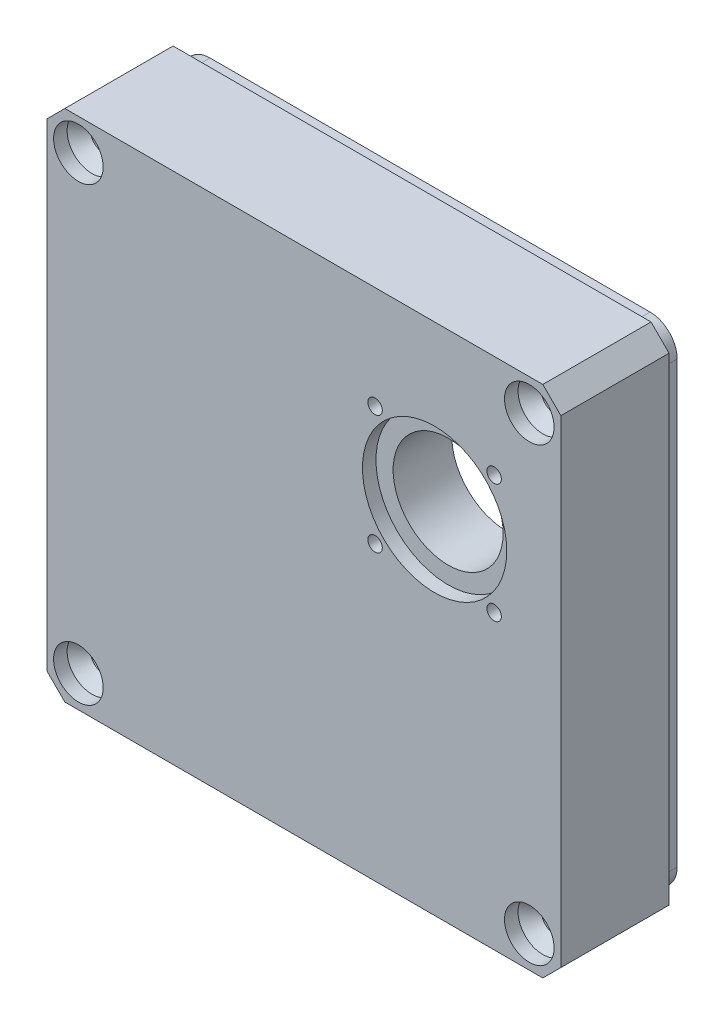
ISO-10303-21;
HEADER;
FILE_DESCRIPTION(('STEP AP214'),'2;1');
FILE_NAME('part.step','',(''),(''),'','','');
FILE_SCHEMA(('AUTOMOTIVE_DESIGN { 1 0 10303 214 1 1 1 1 }'));
ENDSEC;
DATA;
#1=APPLICATION_CONTEXT('core data for automotive mechanical design processes');
#2=APPLICATION_PROTOCOL_DEFINITION('international standard','automotive_design',2000,#1);
#3=PRODUCT_CONTEXT('',#1,'mechanical');
#4=PRODUCT('Part','Part','',(#3));
#5=PRODUCT_RELATED_PRODUCT_CATEGORY('part','',(#4));
#6=PRODUCT_DEFINITION_FORMATION('','',#4);
#7=PRODUCT_DEFINITION_CONTEXT('part definition',#1,'design');
#8=PRODUCT_DEFINITION('design','',#6,#7);
#9=PRODUCT_DEFINITION_SHAPE('','',#8);
#10=(LENGTH_UNIT() NAMED_UNIT(*) SI_UNIT(.MILLI.,.METRE.));
#11=(NAMED_UNIT(*) PLANE_ANGLE_UNIT() SI_UNIT($,.RADIAN.));
#12=(NAMED_UNIT(*) SI_UNIT($,.STERADIAN.) SOLID_ANGLE_UNIT());
#13=UNCERTAINTY_MEASURE_WITH_UNIT(LENGTH_MEASURE(1.E-05),#10,'distance_accuracy_value','');
#14=(GEOMETRIC_REPRESENTATION_CONTEXT(3) GLOBAL_UNCERTAINTY_ASSIGNED_CONTEXT((#13)) GLOBAL_UNIT_ASSIGNED_CONTEXT((#10,
#11,#12)) REPRESENTATION_CONTEXT('',''));
#15=CARTESIAN_POINT('',(0.,0.,0.));
#16=DIRECTION('',(0.,0.,1.));
#17=DIRECTION('',(1.,0.,0.));
#18=AXIS2_PLACEMENT_3D('',#15,#16,#17);
#19=CARTESIAN_POINT('',(14.5,10.5,14.));
#20=DIRECTION('',(0.,0.,-1.));
#21=DIRECTION('',(-1.,0.,0.));
#22=AXIS2_PLACEMENT_3D('',#19,#20,#21);
#23=CYLINDRICAL_SURFACE('',#22,6.1);
#24=CARTESIAN_POINT('',(14.5,10.5,6.));
#25=DIRECTION('',(0.,0.,1.));
#26=DIRECTION('',(1.,0.,0.));
#27=AXIS2_PLACEMENT_3D('',#24,#25,#26);
#28=CIRCLE('',#27,6.1);
#29=CARTESIAN_POINT('',(20.6,10.5,6.));
#30=VERTEX_POINT('',#29);
#31=EDGE_CURVE('E405',#30,#30,#28,.F.);
#32=ORIENTED_EDGE('',*,*,#31,.T.);
#33=EDGE_LOOP('',(#32));
#34=FACE_BOUND('',#33,.T.);
#35=CARTESIAN_POINT('',(14.5,10.5,12.5));
#36=DIRECTION('',(0.,0.,1.));
#37=DIRECTION('',(1.,0.,0.));
#38=AXIS2_PLACEMENT_3D('',#35,#36,#37);
#39=CIRCLE('',#38,6.1);
#40=CARTESIAN_POINT('',(20.6,10.5,12.5));
#41=VERTEX_POINT('',#40);
#42=EDGE_CURVE('E396',#41,#41,#39,.F.);
#43=ORIENTED_EDGE('',*,*,#42,.F.);
#44=EDGE_LOOP('',(#43));
#45=FACE_BOUND('',#44,.T.);
#46=ADVANCED_FACE('F37',(#34,#45),#23,.F.);
#47=CARTESIAN_POINT('',(-28.5,-26.5,14.));
#48=DIRECTION('',(1.,0.,0.));
#49=DIRECTION('',(0.,0.,-1.));
#50=AXIS2_PLACEMENT_3D('',#47,#48,#49);
#51=PLANE('',#50);
#52=DIRECTION('',(0.,0.,-1.));
#53=VECTOR('',#52,1.);
#54=CARTESIAN_POINT('',(-28.5,26.5,14.));
#55=LINE('',#54,#53);
#56=CARTESIAN_POINT('',(-28.5,26.5,14.));
#57=VERTEX_POINT('',#56);
#58=CARTESIAN_POINT('',(-28.5,26.5,2.));
#59=VERTEX_POINT('',#58);
#60=EDGE_CURVE('E539',#57,#59,#55,.T.);
#61=ORIENTED_EDGE('',*,*,#60,.T.);
#62=DIRECTION('',(0.,1.,0.));
#63=VECTOR('',#62,1.);
#64=CARTESIAN_POINT('',(-28.5,26.5,2.));
#65=LINE('',#64,#63);
#66=CARTESIAN_POINT('',(-28.5,-26.5,2.));
#67=VERTEX_POINT('',#66);
#68=EDGE_CURVE('E510',#67,#59,#65,.T.);
#69=ORIENTED_EDGE('',*,*,#68,.F.);
#70=DIRECTION('',(0.,0.,-1.));
#71=VECTOR('',#70,1.);
#72=CARTESIAN_POINT('',(-28.5,-26.5,14.));
#73=LINE('',#72,#71);
#74=CARTESIAN_POINT('',(-28.5,-26.5,14.));
#75=VERTEX_POINT('',#74);
#76=EDGE_CURVE('E560',#75,#67,#73,.T.);
#77=ORIENTED_EDGE('',*,*,#76,.F.);
#78=DIRECTION('',(0.,-1.,0.));
#79=VECTOR('',#78,1.);
#80=CARTESIAN_POINT('',(-28.5,-26.5,14.));
#81=LINE('',#80,#79);
#82=EDGE_CURVE('E522',#57,#75,#81,.T.);
#83=ORIENTED_EDGE('',*,*,#82,.F.);
#84=EDGE_LOOP('',(#61,#69,#77,#83));
#85=FACE_BOUND('',#84,.T.);
#86=ADVANCED_FACE('F702',(#85),#51,.F.);
#87=CARTESIAN_POINT('',(-26.5,-28.5,14.));
#88=DIRECTION('',(0.707106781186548,0.707106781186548,0.));
#89=DIRECTION('',(-0.707106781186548,0.707106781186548,0.));
#90=AXIS2_PLACEMENT_3D('',#87,#88,#89);
#91=PLANE('',#90);
#92=ORIENTED_EDGE('',*,*,#76,.T.);
#93=DIRECTION('',(-0.707106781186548,0.707106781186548,0.));
#94=VECTOR('',#93,1.);
#95=CARTESIAN_POINT('',(-28.5,-26.5,2.));
#96=LINE('',#95,#94);
#97=CARTESIAN_POINT('',(-26.5,-28.5,2.));
#98=VERTEX_POINT('',#97);
#99=EDGE_CURVE('E508',#98,#67,#96,.T.);
#100=ORIENTED_EDGE('',*,*,#99,.F.);
#101=DIRECTION('',(0.,0.,-1.));
#102=VECTOR('',#101,1.);
#103=CARTESIAN_POINT('',(-26.5,-28.5,14.));
#104=LINE('',#103,#102);
#105=CARTESIAN_POINT('',(-26.5,-28.5,14.));
#106=VERTEX_POINT('',#105);
#107=EDGE_CURVE('E557',#106,#98,#104,.T.);
#108=ORIENTED_EDGE('',*,*,#107,.F.);
#109=DIRECTION('',(0.707106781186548,-0.707106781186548,0.));
#110=VECTOR('',#109,1.);
#111=CARTESIAN_POINT('',(-26.5,-28.5,14.));
#112=LINE('',#111,#110);
#113=EDGE_CURVE('E525',#75,#106,#112,.T.);
#114=ORIENTED_EDGE('',*,*,#113,.F.);
#115=EDGE_LOOP('',(#92,#100,#108,#114));
#116=FACE_BOUND('',#115,.T.);
#117=ADVANCED_FACE('F705',(#116),#91,.F.);
#118=CARTESIAN_POINT('',(-26.5,-28.5,14.));
#119=DIRECTION('',(0.,1.,0.));
#120=DIRECTION('',(0.,0.,1.));
#121=AXIS2_PLACEMENT_3D('',#118,#119,#120);
#122=PLANE('',#121);
#123=ORIENTED_EDGE('',*,*,#107,.T.);
#124=DIRECTION('',(-1.,0.,0.));
#125=VECTOR('',#124,1.);
#126=CARTESIAN_POINT('',(-26.5,-28.5,2.));
#127=LINE('',#126,#125);
#128=CARTESIAN_POINT('',(26.5,-28.5,2.));
#129=VERTEX_POINT('',#128);
#130=EDGE_CURVE('E492',#129,#98,#127,.T.);
#131=ORIENTED_EDGE('',*,*,#130,.F.);
#132=DIRECTION('',(0.,0.,-1.));
#133=VECTOR('',#132,1.);
#134=CARTESIAN_POINT('',(26.5,-28.5,14.));
#135=LINE('',#134,#133);
#136=CARTESIAN_POINT('',(26.5,-28.5,14.));
#137=VERTEX_POINT('',#136);
#138=EDGE_CURVE('E554',#137,#129,#135,.T.);
#139=ORIENTED_EDGE('',*,*,#138,.F.);
#140=DIRECTION('',(1.,0.,0.));
#141=VECTOR('',#140,1.);
#142=CARTESIAN_POINT('',(-26.5,-28.5,14.));
#143=LINE('',#142,#141);
#144=EDGE_CURVE('E527',#106,#137,#143,.T.);
#145=ORIENTED_EDGE('',*,*,#144,.F.);
#146=EDGE_LOOP('',(#123,#131,#139,#145));
#147=FACE_BOUND('',#146,.T.);
#148=ADVANCED_FACE('F710',(#147),#122,.F.);
#149=CARTESIAN_POINT('',(26.5,-28.5,14.));
#150=DIRECTION('',(-0.707106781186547,0.707106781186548,0.));
#151=DIRECTION('',(-0.707106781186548,-0.707106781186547,0.));
#152=AXIS2_PLACEMENT_3D('',#149,#150,#151);
#153=PLANE('',#152);
#154=ORIENTED_EDGE('',*,*,#138,.T.);
#155=DIRECTION('',(-0.707106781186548,-0.707106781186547,0.));
#156=VECTOR('',#155,1.);
#157=CARTESIAN_POINT('',(26.5,-28.5,2.));
#158=LINE('',#157,#156);
#159=CARTESIAN_POINT('',(28.5,-26.5,2.));
#160=VERTEX_POINT('',#159);
#161=EDGE_CURVE('E520',#160,#129,#158,.T.);
#162=ORIENTED_EDGE('',*,*,#161,.F.);
#163=DIRECTION('',(0.,0.,-1.));
#164=VECTOR('',#163,1.);
#165=CARTESIAN_POINT('',(28.5,-26.5,14.));
#166=LINE('',#165,#164);
#167=CARTESIAN_POINT('',(28.5,-26.5,14.));
#168=VERTEX_POINT('',#167);
#169=EDGE_CURVE('E551',#168,#160,#166,.T.);
#170=ORIENTED_EDGE('',*,*,#169,.F.);
#171=DIRECTION('',(0.707106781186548,0.707106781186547,0.));
#172=VECTOR('',#171,1.);
#173=CARTESIAN_POINT('',(26.5,-28.5,14.));
#174=LINE('',#173,#172);
#175=EDGE_CURVE('E529',#137,#168,#174,.T.);
#176=ORIENTED_EDGE('',*,*,#175,.F.);
#177=EDGE_LOOP('',(#154,#162,#170,#176));
#178=FACE_BOUND('',#177,.T.);
#179=ADVANCED_FACE('F717',(#178),#153,.F.);
#180=CARTESIAN_POINT('',(28.5,-26.5,14.));
#181=DIRECTION('',(-1.,0.,0.));
#182=DIRECTION('',(0.,-1.,0.));
#183=AXIS2_PLACEMENT_3D('',#180,#181,#182);
#184=PLANE('',#183);
#185=ORIENTED_EDGE('',*,*,#169,.T.);
#186=DIRECTION('',(0.,-1.,0.));
#187=VECTOR('',#186,1.);
#188=CARTESIAN_POINT('',(28.5,-26.5,2.));
#189=LINE('',#188,#187);
#190=CARTESIAN_POINT('',(28.5,26.5,2.));
#191=VERTEX_POINT('',#190);
#192=EDGE_CURVE('E518',#191,#160,#189,.T.);
#193=ORIENTED_EDGE('',*,*,#192,.F.);
#194=DIRECTION('',(0.,0.,-1.));
#195=VECTOR('',#194,1.);
#196=CARTESIAN_POINT('',(28.5,26.5,14.));
#197=LINE('',#196,#195);
#198=CARTESIAN_POINT('',(28.5,26.5,14.));
#199=VERTEX_POINT('',#198);
#200=EDGE_CURVE('E548',#199,#191,#197,.T.);
#201=ORIENTED_EDGE('',*,*,#200,.F.);
#202=DIRECTION('',(0.,1.,0.));
#203=VECTOR('',#202,1.);
#204=CARTESIAN_POINT('',(28.5,-26.5,14.));
#205=LINE('',#204,#203);
#206=EDGE_CURVE('E531',#168,#199,#205,.T.);
#207=ORIENTED_EDGE('',*,*,#206,.F.);
#208=EDGE_LOOP('',(#185,#193,#201,#207));
#209=FACE_BOUND('',#208,.T.);
#210=ADVANCED_FACE('F720',(#209),#184,.F.);
#211=CARTESIAN_POINT('',(28.5,26.5,14.));
#212=DIRECTION('',(-0.707106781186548,-0.707106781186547,0.));
#213=DIRECTION('',(0.707106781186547,-0.707106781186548,0.));
#214=AXIS2_PLACEMENT_3D('',#211,#212,#213);
#215=PLANE('',#214);
#216=ORIENTED_EDGE('',*,*,#200,.T.);
#217=DIRECTION('',(0.707106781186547,-0.707106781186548,0.));
#218=VECTOR('',#217,1.);
#219=CARTESIAN_POINT('',(28.5,26.5,2.));
#220=LINE('',#219,#218);
#221=CARTESIAN_POINT('',(26.5,28.5,2.));
#222=VERTEX_POINT('',#221);
#223=EDGE_CURVE('E516',#222,#191,#220,.T.);
#224=ORIENTED_EDGE('',*,*,#223,.F.);
#225=DIRECTION('',(0.,0.,-1.));
#226=VECTOR('',#225,1.);
#227=CARTESIAN_POINT('',(26.5,28.5,14.));
#228=LINE('',#227,#226);
#229=CARTESIAN_POINT('',(26.5,28.5,14.));
#230=VERTEX_POINT('',#229);
#231=EDGE_CURVE('E545',#230,#222,#228,.T.);
#232=ORIENTED_EDGE('',*,*,#231,.F.);
#233=DIRECTION('',(-0.707106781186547,0.707106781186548,0.));
#234=VECTOR('',#233,1.);
#235=CARTESIAN_POINT('',(28.5,26.5,14.));
#236=LINE('',#235,#234);
#237=EDGE_CURVE('E533',#199,#230,#236,.T.);
#238=ORIENTED_EDGE('',*,*,#237,.F.);
#239=EDGE_LOOP('',(#216,#224,#232,#238));
#240=FACE_BOUND('',#239,.T.);
#241=ADVANCED_FACE('F725',(#240),#215,.F.);
#242=CARTESIAN_POINT('',(-26.5,28.5,14.));
#243=DIRECTION('',(0.,-1.,0.));
#244=DIRECTION('',(1.,0.,0.));
#245=AXIS2_PLACEMENT_3D('',#242,#243,#244);
#246=PLANE('',#245);
#247=ORIENTED_EDGE('',*,*,#231,.T.);
#248=DIRECTION('',(1.,0.,0.));
#249=VECTOR('',#248,1.);
#250=CARTESIAN_POINT('',(26.5,28.5,2.));
#251=LINE('',#250,#249);
#252=CARTESIAN_POINT('',(-26.5,28.5,2.));
#253=VERTEX_POINT('',#252);
#254=EDGE_CURVE('E514',#253,#222,#251,.T.);
#255=ORIENTED_EDGE('',*,*,#254,.F.);
#256=DIRECTION('',(0.,0.,-1.));
#257=VECTOR('',#256,1.);
#258=CARTESIAN_POINT('',(-26.5,28.5,14.));
#259=LINE('',#258,#257);
#260=CARTESIAN_POINT('',(-26.5,28.5,14.));
#261=VERTEX_POINT('',#260);
#262=EDGE_CURVE('E542',#261,#253,#259,.T.);
#263=ORIENTED_EDGE('',*,*,#262,.F.);
#264=DIRECTION('',(-1.,0.,0.));
#265=VECTOR('',#264,1.);
#266=CARTESIAN_POINT('',(-26.5,28.5,14.));
#267=LINE('',#266,#265);
#268=EDGE_CURVE('E535',#230,#261,#267,.T.);
#269=ORIENTED_EDGE('',*,*,#268,.F.);
#270=EDGE_LOOP('',(#247,#255,#263,#269));
#271=FACE_BOUND('',#270,.T.);
#272=ADVANCED_FACE('F730',(#271),#246,.F.);
#273=CARTESIAN_POINT('',(-28.5,26.5,14.));
#274=DIRECTION('',(0.707106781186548,-0.707106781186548,0.));
#275=DIRECTION('',(0.707106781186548,0.707106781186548,0.));
#276=AXIS2_PLACEMENT_3D('',#273,#274,#275);
#277=PLANE('',#276);
#278=ORIENTED_EDGE('',*,*,#262,.T.);
#279=DIRECTION('',(0.707106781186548,0.707106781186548,0.));
#280=VECTOR('',#279,1.);
#281=CARTESIAN_POINT('',(-26.5,28.5,2.));
#282=LINE('',#281,#280);
#283=EDGE_CURVE('E512',#59,#253,#282,.T.);
#284=ORIENTED_EDGE('',*,*,#283,.F.);
#285=ORIENTED_EDGE('',*,*,#60,.F.);
#286=DIRECTION('',(-0.707106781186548,-0.707106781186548,0.));
#287=VECTOR('',#286,1.);
#288=CARTESIAN_POINT('',(-28.5,26.5,14.));
#289=LINE('',#288,#287);
#290=EDGE_CURVE('E537',#261,#57,#289,.T.);
#291=ORIENTED_EDGE('',*,*,#290,.F.);
#292=EDGE_LOOP('',(#278,#284,#285,#291));
#293=FACE_BOUND('',#292,.T.);
#294=ADVANCED_FACE('F678',(#293),#277,.F.);
#295=CARTESIAN_POINT('',(0.,0.,14.));
#296=DIRECTION('',(0.,0.,-1.));
#297=DIRECTION('',(-1.,0.,0.));
#298=AXIS2_PLACEMENT_3D('',#295,#296,#297);
#299=PLANE('',#298);
#300=CARTESIAN_POINT('',(-25.,25.0000000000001,14.));
#301=DIRECTION('',(0.,0.,1.));
#302=DIRECTION('',(1.,0.,0.));
#303=AXIS2_PLACEMENT_3D('',#300,#301,#302);
#304=CIRCLE('',#303,2.75);
#305=CARTESIAN_POINT('',(-22.25,25.0000000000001,14.));
#306=VERTEX_POINT('',#305);
#307=EDGE_CURVE('E1350',#306,#306,#304,.T.);
#308=ORIENTED_EDGE('',*,*,#307,.F.);
#309=EDGE_LOOP('',(#308));
#310=FACE_BOUND('',#309,.T.);
#311=CARTESIAN_POINT('',(25.,24.9999999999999,14.));
#312=DIRECTION('',(0.,0.,1.));
#313=DIRECTION('',(1.,0.,0.));
#314=AXIS2_PLACEMENT_3D('',#311,#312,#313);
#315=CIRCLE('',#314,2.75);
#316=CARTESIAN_POINT('',(27.75,24.9999999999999,14.));
#317=VERTEX_POINT('',#316);
#318=EDGE_CURVE('E639',#317,#317,#315,.T.);
#319=ORIENTED_EDGE('',*,*,#318,.F.);
#320=EDGE_LOOP('',(#319));
#321=FACE_BOUND('',#320,.T.);
#322=CARTESIAN_POINT('',(24.9999999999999,-24.9999999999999,14.));
#323=DIRECTION('',(0.,0.,1.));
#324=DIRECTION('',(1.,0.,0.));
#325=AXIS2_PLACEMENT_3D('',#322,#323,#324);
#326=CIRCLE('',#325,2.75);
#327=CARTESIAN_POINT('',(27.7499999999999,-24.9999999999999,14.));
#328=VERTEX_POINT('',#327);
#329=EDGE_CURVE('E643',#328,#328,#326,.T.);
#330=ORIENTED_EDGE('',*,*,#329,.F.);
#331=EDGE_LOOP('',(#330));
#332=FACE_BOUND('',#331,.T.);
#333=CARTESIAN_POINT('',(-25.,-24.9999999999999,14.));
#334=DIRECTION('',(0.,0.,1.));
#335=DIRECTION('',(1.,0.,0.));
#336=AXIS2_PLACEMENT_3D('',#333,#334,#335);
#337=CIRCLE('',#336,2.75);
#338=CARTESIAN_POINT('',(-22.25,-24.9999999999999,14.));
#339=VERTEX_POINT('',#338);
#340=EDGE_CURVE('E650',#339,#339,#337,.T.);
#341=ORIENTED_EDGE('',*,*,#340,.F.);
#342=EDGE_LOOP('',(#341));
#343=FACE_BOUND('',#342,.T.);
#344=CARTESIAN_POINT('',(14.5,10.5,14.));
#345=DIRECTION('',(0.,0.,1.));
#346=DIRECTION('',(1.,0.,0.));
#347=AXIS2_PLACEMENT_3D('',#344,#345,#346);
#348=CIRCLE('',#347,8.);
#349=CARTESIAN_POINT('',(22.5,10.5,14.));
#350=VERTEX_POINT('',#349);
#351=EDGE_CURVE('E385',#350,#350,#348,.T.);
#352=ORIENTED_EDGE('',*,*,#351,.F.);
#353=EDGE_LOOP('',(#352));
#354=FACE_BOUND('',#353,.T.);
#355=CARTESIAN_POINT('',(7.90000000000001,3.9,14.));
#356=DIRECTION('',(0.,0.,1.));
#357=DIRECTION('',(1.,0.,0.));
#358=AXIS2_PLACEMENT_3D('',#355,#356,#357);
#359=CIRCLE('',#358,0.79999999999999);
#360=CARTESIAN_POINT('',(8.7,3.9,14.));
#361=VERTEX_POINT('',#360);
#362=EDGE_CURVE('E417',#361,#361,#359,.T.);
#363=ORIENTED_EDGE('',*,*,#362,.F.);
#364=EDGE_LOOP('',(#363));
#365=FACE_BOUND('',#364,.T.);
#366=CARTESIAN_POINT('',(7.90000000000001,17.1,14.));
#367=DIRECTION('',(0.,0.,1.));
#368=DIRECTION('',(1.,0.,0.));
#369=AXIS2_PLACEMENT_3D('',#366,#367,#368);
#370=CIRCLE('',#369,0.79999999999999);
#371=CARTESIAN_POINT('',(8.7,17.1,14.));
#372=VERTEX_POINT('',#371);
#373=EDGE_CURVE('E423',#372,#372,#370,.T.);
#374=ORIENTED_EDGE('',*,*,#373,.F.);
#375=EDGE_LOOP('',(#374));
#376=FACE_BOUND('',#375,.T.);
#377=CARTESIAN_POINT('',(21.1,17.1,14.));
#378=DIRECTION('',(0.,0.,1.));
#379=DIRECTION('',(1.,0.,0.));
#380=AXIS2_PLACEMENT_3D('',#377,#378,#379);
#381=CIRCLE('',#380,0.799999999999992);
#382=CARTESIAN_POINT('',(21.9,17.1,14.));
#383=VERTEX_POINT('',#382);
#384=EDGE_CURVE('E429',#383,#383,#381,.T.);
#385=ORIENTED_EDGE('',*,*,#384,.F.);
#386=EDGE_LOOP('',(#385));
#387=FACE_BOUND('',#386,.T.);
#388=CARTESIAN_POINT('',(21.1,3.9,14.));
#389=DIRECTION('',(0.,0.,1.));
#390=DIRECTION('',(1.,0.,0.));
#391=AXIS2_PLACEMENT_3D('',#388,#389,#390);
#392=CIRCLE('',#391,0.799999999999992);
#393=CARTESIAN_POINT('',(21.9,3.9,14.));
#394=VERTEX_POINT('',#393);
#395=EDGE_CURVE('E435',#394,#394,#392,.T.);
#396=ORIENTED_EDGE('',*,*,#395,.F.);
#397=EDGE_LOOP('',(#396));
#398=FACE_BOUND('',#397,.T.);
#399=ORIENTED_EDGE('',*,*,#82,.T.);
#400=ORIENTED_EDGE('',*,*,#113,.T.);
#401=ORIENTED_EDGE('',*,*,#144,.T.);
#402=ORIENTED_EDGE('',*,*,#175,.T.);
#403=ORIENTED_EDGE('',*,*,#206,.T.);
#404=ORIENTED_EDGE('',*,*,#237,.T.);
#405=ORIENTED_EDGE('',*,*,#268,.T.);
#406=ORIENTED_EDGE('',*,*,#290,.T.);
#407=EDGE_LOOP('',(#399,#400,#401,#402,#403,#404,#405,#406));
#408=FACE_BOUND('',#407,.T.);
#409=ADVANCED_FACE('F674',(#310,#321,#332,#343,#354,#365,#376,#387,#398,#408),#299,.F.);
#410=CARTESIAN_POINT('',(0.,0.,2.));
#411=DIRECTION('',(0.,0.,1.));
#412=DIRECTION('',(1.,0.,0.));
#413=AXIS2_PLACEMENT_3D('',#410,#411,#412);
#414=PLANE('',#413);
#415=CARTESIAN_POINT('',(-24.4,-24.4,2.));
#416=DIRECTION('',(0.,0.,-1.));
#417=DIRECTION('',(1.,0.,0.));
#418=AXIS2_PLACEMENT_3D('',#415,#416,#417);
#419=CIRCLE('',#418,3.);
#420=CARTESIAN_POINT('',(-24.4,-27.4,2.));
#421=VERTEX_POINT('',#420);
#422=CARTESIAN_POINT('',(-27.4,-24.4,2.));
#423=VERTEX_POINT('',#422);
#424=EDGE_CURVE('E442',#421,#423,#419,.T.);
#425=ORIENTED_EDGE('',*,*,#424,.F.);
#426=DIRECTION('',(-1.,0.,0.));
#427=VECTOR('',#426,1.);
#428=CARTESIAN_POINT('',(24.4,-27.4,2.));
#429=LINE('',#428,#427);
#430=CARTESIAN_POINT('',(24.4,-27.4,2.));
#431=VERTEX_POINT('',#430);
#432=EDGE_CURVE('E464',#431,#421,#429,.T.);
#433=ORIENTED_EDGE('',*,*,#432,.F.);
#434=CARTESIAN_POINT('',(24.4,-24.4,2.));
#435=DIRECTION('',(0.,0.,-1.));
#436=DIRECTION('',(1.,0.,0.));
#437=AXIS2_PLACEMENT_3D('',#434,#435,#436);
#438=CIRCLE('',#437,3.);
#439=CARTESIAN_POINT('',(27.4,-24.4,2.));
#440=VERTEX_POINT('',#439);
#441=EDGE_CURVE('E461',#440,#431,#438,.T.);
#442=ORIENTED_EDGE('',*,*,#441,.F.);
#443=DIRECTION('',(0.,-1.,0.));
#444=VECTOR('',#443,1.);
#445=CARTESIAN_POINT('',(27.4,-24.4,2.));
#446=LINE('',#445,#444);
#447=CARTESIAN_POINT('',(27.4,24.4,2.));
#448=VERTEX_POINT('',#447);
#449=EDGE_CURVE('E458',#448,#440,#446,.T.);
#450=ORIENTED_EDGE('',*,*,#449,.F.);
#451=CARTESIAN_POINT('',(24.4,24.4,2.));
#452=DIRECTION('',(0.,0.,-1.));
#453=DIRECTION('',(-1.,0.,0.));
#454=AXIS2_PLACEMENT_3D('',#451,#452,#453);
#455=CIRCLE('',#454,3.);
#456=CARTESIAN_POINT('',(24.4,27.4,2.));
#457=VERTEX_POINT('',#456);
#458=EDGE_CURVE('E455',#457,#448,#455,.T.);
#459=ORIENTED_EDGE('',*,*,#458,.F.);
#460=DIRECTION('',(1.,0.,0.));
#461=VECTOR('',#460,1.);
#462=CARTESIAN_POINT('',(24.4,27.4,2.));
#463=LINE('',#462,#461);
#464=CARTESIAN_POINT('',(-24.4,27.4,2.));
#465=VERTEX_POINT('',#464);
#466=EDGE_CURVE('E452',#465,#457,#463,.T.);
#467=ORIENTED_EDGE('',*,*,#466,.F.);
#468=CARTESIAN_POINT('',(-24.4,24.4,2.));
#469=DIRECTION('',(0.,0.,-1.));
#470=DIRECTION('',(-1.,0.,0.));
#471=AXIS2_PLACEMENT_3D('',#468,#469,#470);
#472=CIRCLE('',#471,3.);
#473=CARTESIAN_POINT('',(-27.4,24.4,2.));
#474=VERTEX_POINT('',#473);
#475=EDGE_CURVE('E449',#474,#465,#472,.T.);
#476=ORIENTED_EDGE('',*,*,#475,.F.);
#477=DIRECTION('',(0.,1.,0.));
#478=VECTOR('',#477,1.);
#479=CARTESIAN_POINT('',(-27.4,-24.4,2.));
#480=LINE('',#479,#478);
#481=EDGE_CURVE('E445',#423,#474,#480,.T.);
#482=ORIENTED_EDGE('',*,*,#481,.F.);
#483=EDGE_LOOP('',(#425,#433,#442,#450,#459,#467,#476,#482));
#484=FACE_BOUND('',#483,.T.);
#485=ORIENTED_EDGE('',*,*,#130,.T.);
#486=ORIENTED_EDGE('',*,*,#99,.T.);
#487=ORIENTED_EDGE('',*,*,#68,.T.);
#488=ORIENTED_EDGE('',*,*,#283,.T.);
#489=ORIENTED_EDGE('',*,*,#254,.T.);
#490=ORIENTED_EDGE('',*,*,#223,.T.);
#491=ORIENTED_EDGE('',*,*,#192,.T.);
#492=ORIENTED_EDGE('',*,*,#161,.T.);
#493=EDGE_LOOP('',(#485,#486,#487,#488,#489,#490,#491,#492));
#494=FACE_BOUND('',#493,.T.);
#495=ADVANCED_FACE('F677',(#484,#494),#414,.F.);
#496=CARTESIAN_POINT('',(-24.4,-24.4,2.));
#497=DIRECTION('',(0.,0.,-1.));
#498=DIRECTION('',(-1.,0.,0.));
#499=AXIS2_PLACEMENT_3D('',#496,#497,#498);
#500=CYLINDRICAL_SURFACE('',#499,3.);
#501=CARTESIAN_POINT('',(-24.4,-24.4,0.));
#502=DIRECTION('',(0.,0.,-1.));
#503=DIRECTION('',(1.,0.,0.));
#504=AXIS2_PLACEMENT_3D('',#501,#502,#503);
#505=CIRCLE('',#504,3.);
#506=CARTESIAN_POINT('',(-24.4,-27.4,0.));
#507=VERTEX_POINT('',#506);
#508=CARTESIAN_POINT('',(-27.4,-24.4,0.));
#509=VERTEX_POINT('',#508);
#510=EDGE_CURVE('E441',#507,#509,#505,.T.);
#511=ORIENTED_EDGE('',*,*,#510,.F.);
#512=DIRECTION('',(0.,0.,-1.));
#513=VECTOR('',#512,1.);
#514=CARTESIAN_POINT('',(-24.4,-27.4,2.));
#515=LINE('',#514,#513);
#516=EDGE_CURVE('E490',#421,#507,#515,.T.);
#517=ORIENTED_EDGE('',*,*,#516,.F.);
#518=ORIENTED_EDGE('',*,*,#424,.T.);
#519=DIRECTION('',(0.,0.,-1.));
#520=VECTOR('',#519,1.);
#521=CARTESIAN_POINT('',(-27.4,-24.4,2.));
#522=LINE('',#521,#520);
#523=EDGE_CURVE('E467',#423,#509,#522,.T.);
#524=ORIENTED_EDGE('',*,*,#523,.T.);
#525=EDGE_LOOP('',(#511,#517,#518,#524));
#526=FACE_BOUND('',#525,.T.);
#527=ADVANCED_FACE('F735',(#526),#500,.T.);
#528=CARTESIAN_POINT('',(24.4,-27.4,2.));
#529=DIRECTION('',(0.,-1.,0.));
#530=DIRECTION('',(0.,0.,-1.));
#531=AXIS2_PLACEMENT_3D('',#528,#529,#530);
#532=PLANE('',#531);
#533=DIRECTION('',(-1.,0.,0.));
#534=VECTOR('',#533,1.);
#535=CARTESIAN_POINT('',(24.4,-27.4,0.));
#536=LINE('',#535,#534);
#537=CARTESIAN_POINT('',(24.4,-27.4,0.));
#538=VERTEX_POINT('',#537);
#539=EDGE_CURVE('E446',#538,#507,#536,.T.);
#540=ORIENTED_EDGE('',*,*,#539,.F.);
#541=DIRECTION('',(0.,0.,-1.));
#542=VECTOR('',#541,1.);
#543=CARTESIAN_POINT('',(24.4,-27.4,2.));
#544=LINE('',#543,#542);
#545=EDGE_CURVE('E493',#431,#538,#544,.T.);
#546=ORIENTED_EDGE('',*,*,#545,.F.);
#547=ORIENTED_EDGE('',*,*,#432,.T.);
#548=ORIENTED_EDGE('',*,*,#516,.T.);
#549=EDGE_LOOP('',(#540,#546,#547,#548));
#550=FACE_BOUND('',#549,.T.);
#551=ADVANCED_FACE('F741',(#550),#532,.T.);
#552=CARTESIAN_POINT('',(24.4,-24.4,2.));
#553=DIRECTION('',(0.,0.,-1.));
#554=DIRECTION('',(-1.,0.,0.));
#555=AXIS2_PLACEMENT_3D('',#552,#553,#554);
#556=CYLINDRICAL_SURFACE('',#555,3.);
#557=CARTESIAN_POINT('',(24.4,-24.4,0.));
#558=DIRECTION('',(0.,0.,-1.));
#559=DIRECTION('',(1.,0.,0.));
#560=AXIS2_PLACEMENT_3D('',#557,#558,#559);
#561=CIRCLE('',#560,3.);
#562=CARTESIAN_POINT('',(27.4,-24.4,0.));
#563=VERTEX_POINT('',#562);
#564=EDGE_CURVE('E485',#563,#538,#561,.T.);
#565=ORIENTED_EDGE('',*,*,#564,.F.);
#566=DIRECTION('',(0.,0.,-1.));
#567=VECTOR('',#566,1.);
#568=CARTESIAN_POINT('',(27.4,-24.4,2.));
#569=LINE('',#568,#567);
#570=EDGE_CURVE('E495',#440,#563,#569,.T.);
#571=ORIENTED_EDGE('',*,*,#570,.F.);
#572=ORIENTED_EDGE('',*,*,#441,.T.);
#573=ORIENTED_EDGE('',*,*,#545,.T.);
#574=EDGE_LOOP('',(#565,#571,#572,#573));
#575=FACE_BOUND('',#574,.T.);
#576=ADVANCED_FACE('F759',(#575),#556,.T.);
#577=CARTESIAN_POINT('',(27.4,-24.4,2.));
#578=DIRECTION('',(1.,0.,0.));
#579=DIRECTION('',(0.,0.,-1.));
#580=AXIS2_PLACEMENT_3D('',#577,#578,#579);
#581=PLANE('',#580);
#582=DIRECTION('',(0.,-1.,0.));
#583=VECTOR('',#582,1.);
#584=CARTESIAN_POINT('',(27.4,-24.4,0.));
#585=LINE('',#584,#583);
#586=CARTESIAN_POINT('',(27.4,24.4,0.));
#587=VERTEX_POINT('',#586);
#588=EDGE_CURVE('E482',#587,#563,#585,.T.);
#589=ORIENTED_EDGE('',*,*,#588,.F.);
#590=DIRECTION('',(0.,0.,-1.));
#591=VECTOR('',#590,1.);
#592=CARTESIAN_POINT('',(27.4,24.4,2.));
#593=LINE('',#592,#591);
#594=EDGE_CURVE('E497',#448,#587,#593,.T.);
#595=ORIENTED_EDGE('',*,*,#594,.F.);
#596=ORIENTED_EDGE('',*,*,#449,.T.);
#597=ORIENTED_EDGE('',*,*,#570,.T.);
#598=EDGE_LOOP('',(#589,#595,#596,#597));
#599=FACE_BOUND('',#598,.T.);
#600=ADVANCED_FACE('F763',(#599),#581,.T.);
#601=CARTESIAN_POINT('',(24.4,24.4,2.));
#602=DIRECTION('',(0.,0.,-1.));
#603=DIRECTION('',(-1.,0.,0.));
#604=AXIS2_PLACEMENT_3D('',#601,#602,#603);
#605=CYLINDRICAL_SURFACE('',#604,3.);
#606=CARTESIAN_POINT('',(24.4,24.4,0.));
#607=DIRECTION('',(0.,0.,-1.));
#608=DIRECTION('',(-1.,0.,0.));
#609=AXIS2_PLACEMENT_3D('',#606,#607,#608);
#610=CIRCLE('',#609,3.);
#611=CARTESIAN_POINT('',(24.4,27.4,0.));
#612=VERTEX_POINT('',#611);
#613=EDGE_CURVE('E479',#612,#587,#610,.T.);
#614=ORIENTED_EDGE('',*,*,#613,.F.);
#615=DIRECTION('',(0.,0.,-1.));
#616=VECTOR('',#615,1.);
#617=CARTESIAN_POINT('',(24.4,27.4,2.));
#618=LINE('',#617,#616);
#619=EDGE_CURVE('E499',#457,#612,#618,.T.);
#620=ORIENTED_EDGE('',*,*,#619,.F.);
#621=ORIENTED_EDGE('',*,*,#458,.T.);
#622=ORIENTED_EDGE('',*,*,#594,.T.);
#623=EDGE_LOOP('',(#614,#620,#621,#622));
#624=FACE_BOUND('',#623,.T.);
#625=ADVANCED_FACE('F767',(#624),#605,.T.);
#626=CARTESIAN_POINT('',(24.4,27.4,2.));
#627=DIRECTION('',(0.,1.,0.));
#628=DIRECTION('',(0.,0.,1.));
#629=AXIS2_PLACEMENT_3D('',#626,#627,#628);
#630=PLANE('',#629);
#631=DIRECTION('',(1.,0.,0.));
#632=VECTOR('',#631,1.);
#633=CARTESIAN_POINT('',(24.4,27.4,0.));
#634=LINE('',#633,#632);
#635=CARTESIAN_POINT('',(-24.4,27.4,0.));
#636=VERTEX_POINT('',#635);
#637=EDGE_CURVE('E476',#636,#612,#634,.T.);
#638=ORIENTED_EDGE('',*,*,#637,.F.);
#639=DIRECTION('',(0.,0.,-1.));
#640=VECTOR('',#639,1.);
#641=CARTESIAN_POINT('',(-24.4,27.4,2.));
#642=LINE('',#641,#640);
#643=EDGE_CURVE('E501',#465,#636,#642,.T.);
#644=ORIENTED_EDGE('',*,*,#643,.F.);
#645=ORIENTED_EDGE('',*,*,#466,.T.);
#646=ORIENTED_EDGE('',*,*,#619,.T.);
#647=EDGE_LOOP('',(#638,#644,#645,#646));
#648=FACE_BOUND('',#647,.T.);
#649=ADVANCED_FACE('F771',(#648),#630,.T.);
#650=CARTESIAN_POINT('',(-24.4,24.4,2.));
#651=DIRECTION('',(0.,0.,-1.));
#652=DIRECTION('',(-1.,0.,0.));
#653=AXIS2_PLACEMENT_3D('',#650,#651,#652);
#654=CYLINDRICAL_SURFACE('',#653,3.);
#655=CARTESIAN_POINT('',(-24.4,24.4,0.));
#656=DIRECTION('',(0.,0.,-1.));
#657=DIRECTION('',(-1.,0.,0.));
#658=AXIS2_PLACEMENT_3D('',#655,#656,#657);
#659=CIRCLE('',#658,3.);
#660=CARTESIAN_POINT('',(-27.4,24.4,0.));
#661=VERTEX_POINT('',#660);
#662=EDGE_CURVE('E473',#661,#636,#659,.T.);
#663=ORIENTED_EDGE('',*,*,#662,.F.);
#664=DIRECTION('',(0.,0.,-1.));
#665=VECTOR('',#664,1.);
#666=CARTESIAN_POINT('',(-27.4,24.4,2.));
#667=LINE('',#666,#665);
#668=EDGE_CURVE('E503',#474,#661,#667,.T.);
#669=ORIENTED_EDGE('',*,*,#668,.F.);
#670=ORIENTED_EDGE('',*,*,#475,.T.);
#671=ORIENTED_EDGE('',*,*,#643,.T.);
#672=EDGE_LOOP('',(#663,#669,#670,#671));
#673=FACE_BOUND('',#672,.T.);
#674=ADVANCED_FACE('F775',(#673),#654,.T.);
#675=CARTESIAN_POINT('',(-27.4,-24.4,2.));
#676=DIRECTION('',(-1.,0.,0.));
#677=DIRECTION('',(0.,0.,1.));
#678=AXIS2_PLACEMENT_3D('',#675,#676,#677);
#679=PLANE('',#678);
#680=DIRECTION('',(0.,1.,0.));
#681=VECTOR('',#680,1.);
#682=CARTESIAN_POINT('',(-27.4,-24.4,0.));
#683=LINE('',#682,#681);
#684=EDGE_CURVE('E470',#509,#661,#683,.T.);
#685=ORIENTED_EDGE('',*,*,#684,.F.);
#686=ORIENTED_EDGE('',*,*,#523,.F.);
#687=ORIENTED_EDGE('',*,*,#481,.T.);
#688=ORIENTED_EDGE('',*,*,#668,.T.);
#689=EDGE_LOOP('',(#685,#686,#687,#688));
#690=FACE_BOUND('',#689,.T.);
#691=ADVANCED_FACE('F779',(#690),#679,.T.);
#692=CARTESIAN_POINT('',(0.,0.,0.));
#693=DIRECTION('',(0.,0.,-1.));
#694=DIRECTION('',(-1.,0.,0.));
#695=AXIS2_PLACEMENT_3D('',#692,#693,#694);
#696=PLANE('',#695);
#697=CARTESIAN_POINT('',(-25.,25.0000000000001,0.));
#698=DIRECTION('',(0.,0.,1.));
#699=DIRECTION('',(1.,0.,0.));
#700=AXIS2_PLACEMENT_3D('',#697,#698,#699);
#701=CIRCLE('',#700,1.44999999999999);
#702=CARTESIAN_POINT('',(-23.55,25.0000000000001,0.));
#703=VERTEX_POINT('',#702);
#704=EDGE_CURVE('E300',#703,#703,#701,.T.);
#705=ORIENTED_EDGE('',*,*,#704,.T.);
#706=EDGE_LOOP('',(#705));
#707=FACE_BOUND('',#706,.T.);
#708=CARTESIAN_POINT('',(25.,24.9999999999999,0.));
#709=DIRECTION('',(0.,0.,1.));
#710=DIRECTION('',(1.,0.,0.));
#711=AXIS2_PLACEMENT_3D('',#708,#709,#710);
#712=CIRCLE('',#711,1.44999999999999);
#713=CARTESIAN_POINT('',(26.45,24.9999999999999,0.));
#714=VERTEX_POINT('',#713);
#715=EDGE_CURVE('E304',#714,#714,#712,.T.);
#716=ORIENTED_EDGE('',*,*,#715,.T.);
#717=EDGE_LOOP('',(#716));
#718=FACE_BOUND('',#717,.T.);
#719=CARTESIAN_POINT('',(24.9999999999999,-24.9999999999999,0.));
#720=DIRECTION('',(0.,0.,1.));
#721=DIRECTION('',(1.,0.,0.));
#722=AXIS2_PLACEMENT_3D('',#719,#720,#721);
#723=CIRCLE('',#722,1.44999999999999);
#724=CARTESIAN_POINT('',(26.4499999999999,-24.9999999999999,0.));
#725=VERTEX_POINT('',#724);
#726=EDGE_CURVE('E313',#725,#725,#723,.T.);
#727=ORIENTED_EDGE('',*,*,#726,.T.);
#728=EDGE_LOOP('',(#727));
#729=FACE_BOUND('',#728,.T.);
#730=CARTESIAN_POINT('',(-25.,-24.9999999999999,0.));
#731=DIRECTION('',(0.,0.,1.));
#732=DIRECTION('',(1.,0.,0.));
#733=AXIS2_PLACEMENT_3D('',#730,#731,#732);
#734=CIRCLE('',#733,1.44999999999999);
#735=CARTESIAN_POINT('',(-23.55,-24.9999999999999,0.));
#736=VERTEX_POINT('',#735);
#737=EDGE_CURVE('E316',#736,#736,#734,.T.);
#738=ORIENTED_EDGE('',*,*,#737,.T.);
#739=EDGE_LOOP('',(#738));
#740=FACE_BOUND('',#739,.T.);
#741=DIRECTION('',(0.,1.,0.));
#742=VECTOR('',#741,1.);
#743=CARTESIAN_POINT('',(-23.5,-23.5,0.));
#744=LINE('',#743,#742);
#745=CARTESIAN_POINT('',(-23.5,-16.8431457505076,0.));
#746=VERTEX_POINT('',#745);
#747=CARTESIAN_POINT('',(-23.5,16.8431457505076,0.));
#748=VERTEX_POINT('',#747);
#749=EDGE_CURVE('E406',#746,#748,#744,.T.);
#750=ORIENTED_EDGE('',*,*,#749,.F.);
#751=CARTESIAN_POINT('',(-19.5,-16.8431457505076,0.));
#752=DIRECTION('',(0.,0.,-1.));
#753=DIRECTION('',(-1.,0.,0.));
#754=AXIS2_PLACEMENT_3D('',#751,#752,#753);
#755=CIRCLE('',#754,4.);
#756=CARTESIAN_POINT('',(-22.3284271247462,-19.6715728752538,0.));
#757=VERTEX_POINT('',#756);
#758=EDGE_CURVE('E623',#746,#757,#755,.F.);
#759=ORIENTED_EDGE('',*,*,#758,.T.);
#760=DIRECTION('',(-0.707106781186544,0.707106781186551,0.));
#761=VECTOR('',#760,1.);
#762=CARTESIAN_POINT('',(-23.5,-18.5,0.));
#763=LINE('',#762,#761);
#764=CARTESIAN_POINT('',(-19.6715728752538,-22.3284271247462,0.));
#765=VERTEX_POINT('',#764);
#766=EDGE_CURVE('E568',#757,#765,#763,.F.);
#767=ORIENTED_EDGE('',*,*,#766,.T.);
#768=CARTESIAN_POINT('',(-16.8431457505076,-19.5,0.));
#769=DIRECTION('',(0.,0.,-1.));
#770=DIRECTION('',(-1.,0.,0.));
#771=AXIS2_PLACEMENT_3D('',#768,#769,#770);
#772=CIRCLE('',#771,4.);
#773=CARTESIAN_POINT('',(-16.8431457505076,-23.5,0.));
#774=VERTEX_POINT('',#773);
#775=EDGE_CURVE('E625',#765,#774,#772,.F.);
#776=ORIENTED_EDGE('',*,*,#775,.T.);
#777=DIRECTION('',(-1.,0.,0.));
#778=VECTOR('',#777,1.);
#779=CARTESIAN_POINT('',(23.5,-23.5,0.));
#780=LINE('',#779,#778);
#781=CARTESIAN_POINT('',(16.8431457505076,-23.5,0.));
#782=VERTEX_POINT('',#781);
#783=EDGE_CURVE('E402',#782,#774,#780,.T.);
#784=ORIENTED_EDGE('',*,*,#783,.F.);
#785=CARTESIAN_POINT('',(16.8431457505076,-19.5,0.));
#786=DIRECTION('',(0.,0.,-1.));
#787=DIRECTION('',(-1.,0.,0.));
#788=AXIS2_PLACEMENT_3D('',#785,#786,#787);
#789=CIRCLE('',#788,4.);
#790=CARTESIAN_POINT('',(19.6715728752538,-22.3284271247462,0.));
#791=VERTEX_POINT('',#790);
#792=EDGE_CURVE('E627',#782,#791,#789,.F.);
#793=ORIENTED_EDGE('',*,*,#792,.T.);
#794=DIRECTION('',(-0.707106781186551,-0.707106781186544,0.));
#795=VECTOR('',#794,1.);
#796=CARTESIAN_POINT('',(18.5,-23.5,0.));
#797=LINE('',#796,#795);
#798=CARTESIAN_POINT('',(22.3284271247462,-19.6715728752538,0.));
#799=VERTEX_POINT('',#798);
#800=EDGE_CURVE('E573',#791,#799,#797,.F.);
#801=ORIENTED_EDGE('',*,*,#800,.T.);
#802=CARTESIAN_POINT('',(19.5,-16.8431457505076,0.));
#803=DIRECTION('',(0.,0.,-1.));
#804=DIRECTION('',(-1.,0.,0.));
#805=AXIS2_PLACEMENT_3D('',#802,#803,#804);
#806=CIRCLE('',#805,4.);
#807=CARTESIAN_POINT('',(23.5,-16.8431457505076,0.));
#808=VERTEX_POINT('',#807);
#809=EDGE_CURVE('E629',#799,#808,#806,.F.);
#810=ORIENTED_EDGE('',*,*,#809,.T.);
#811=DIRECTION('',(0.,-1.,0.));
#812=VECTOR('',#811,1.);
#813=CARTESIAN_POINT('',(23.5,-23.5,0.));
#814=LINE('',#813,#812);
#815=CARTESIAN_POINT('',(23.5,16.8431457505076,0.));
#816=VERTEX_POINT('',#815);
#817=EDGE_CURVE('E412',#816,#808,#814,.T.);
#818=ORIENTED_EDGE('',*,*,#817,.F.);
#819=CARTESIAN_POINT('',(19.5,16.8431457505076,0.));
#820=DIRECTION('',(0.,0.,-1.));
#821=DIRECTION('',(-1.,0.,0.));
#822=AXIS2_PLACEMENT_3D('',#819,#820,#821);
#823=CIRCLE('',#822,4.);
#824=CARTESIAN_POINT('',(22.3284271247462,19.6715728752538,0.));
#825=VERTEX_POINT('',#824);
#826=EDGE_CURVE('E46',#816,#825,#823,.F.);
#827=ORIENTED_EDGE('',*,*,#826,.T.);
#828=DIRECTION('',(0.707106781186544,-0.707106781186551,0.));
#829=VECTOR('',#828,1.);
#830=CARTESIAN_POINT('',(23.5,18.5,0.));
#831=LINE('',#830,#829);
#832=CARTESIAN_POINT('',(19.6715728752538,22.3284271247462,0.));
#833=VERTEX_POINT('',#832);
#834=EDGE_CURVE('E571',#825,#833,#831,.F.);
#835=ORIENTED_EDGE('',*,*,#834,.T.);
#836=CARTESIAN_POINT('',(16.8431457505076,19.5,0.));
#837=DIRECTION('',(0.,0.,-1.));
#838=DIRECTION('',(-1.,0.,0.));
#839=AXIS2_PLACEMENT_3D('',#836,#837,#838);
#840=CIRCLE('',#839,4.);
#841=CARTESIAN_POINT('',(16.8431457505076,23.5,0.));
#842=VERTEX_POINT('',#841);
#843=EDGE_CURVE('E11',#833,#842,#840,.F.);
#844=ORIENTED_EDGE('',*,*,#843,.T.);
#845=DIRECTION('',(1.,0.,0.));
#846=VECTOR('',#845,1.);
#847=CARTESIAN_POINT('',(23.5,23.5,0.));
#848=LINE('',#847,#846);
#849=CARTESIAN_POINT('',(-16.8431457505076,23.5,0.));
#850=VERTEX_POINT('',#849);
#851=EDGE_CURVE('E409',#850,#842,#848,.T.);
#852=ORIENTED_EDGE('',*,*,#851,.F.);
#853=CARTESIAN_POINT('',(-16.8431457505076,19.5,0.));
#854=DIRECTION('',(0.,0.,-1.));
#855=DIRECTION('',(-1.,0.,0.));
#856=AXIS2_PLACEMENT_3D('',#853,#854,#855);
#857=CIRCLE('',#856,4.);
#858=CARTESIAN_POINT('',(-19.6715728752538,22.3284271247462,0.));
#859=VERTEX_POINT('',#858);
#860=EDGE_CURVE('E621',#850,#859,#857,.F.);
#861=ORIENTED_EDGE('',*,*,#860,.T.);
#862=DIRECTION('',(0.707106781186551,0.707106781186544,0.));
#863=VECTOR('',#862,1.);
#864=CARTESIAN_POINT('',(-18.5,23.5,0.));
#865=LINE('',#864,#863);
#866=CARTESIAN_POINT('',(-22.3284271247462,19.6715728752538,0.));
#867=VERTEX_POINT('',#866);
#868=EDGE_CURVE('E576',#859,#867,#865,.F.);
#869=ORIENTED_EDGE('',*,*,#868,.T.);
#870=CARTESIAN_POINT('',(-19.5,16.8431457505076,0.));
#871=DIRECTION('',(0.,0.,-1.));
#872=DIRECTION('',(-1.,0.,0.));
#873=AXIS2_PLACEMENT_3D('',#870,#871,#872);
#874=CIRCLE('',#873,4.);
#875=EDGE_CURVE('E619',#867,#748,#874,.F.);
#876=ORIENTED_EDGE('',*,*,#875,.T.);
#877=EDGE_LOOP('',(#750,#759,#767,#776,#784,#793,#801,#810,#818,#827,#835,#844,#852,#861,#869,#876));
#878=FACE_BOUND('',#877,.T.);
#879=ORIENTED_EDGE('',*,*,#539,.T.);
#880=ORIENTED_EDGE('',*,*,#510,.T.);
#881=ORIENTED_EDGE('',*,*,#684,.T.);
#882=ORIENTED_EDGE('',*,*,#662,.T.);
#883=ORIENTED_EDGE('',*,*,#637,.T.);
#884=ORIENTED_EDGE('',*,*,#613,.T.);
#885=ORIENTED_EDGE('',*,*,#588,.T.);
#886=ORIENTED_EDGE('',*,*,#564,.T.);
#887=EDGE_LOOP('',(#879,#880,#881,#882,#883,#884,#885,#886));
#888=FACE_BOUND('',#887,.T.);
#889=ADVANCED_FACE('F782',(#707,#718,#729,#740,#878,#888),#696,.T.);
#890=CARTESIAN_POINT('',(21.1,3.9,7.49999999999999));
#891=DIRECTION('',(0.,0.,1.));
#892=DIRECTION('',(1.,0.,0.));
#893=AXIS2_PLACEMENT_3D('',#890,#891,#892);
#894=CONICAL_SURFACE('',#893,0.799999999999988,1.02974425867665);
#895=CARTESIAN_POINT('',(21.1,3.9,7.01931150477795));
#896=VERTEX_POINT('',#895);
#897=VERTEX_LOOP('',#896);
#898=FACE_BOUND('',#897,.T.);
#899=CARTESIAN_POINT('',(21.1,3.9,7.49999999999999));
#900=DIRECTION('',(0.,0.,1.));
#901=DIRECTION('',(1.,0.,0.));
#902=AXIS2_PLACEMENT_3D('',#899,#900,#901);
#903=CIRCLE('',#902,0.799999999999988);
#904=CARTESIAN_POINT('',(21.9,3.9,7.49999999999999));
#905=VERTEX_POINT('',#904);
#906=EDGE_CURVE('E438',#905,#905,#903,.T.);
#907=ORIENTED_EDGE('',*,*,#906,.T.);
#908=EDGE_LOOP('',(#907));
#909=FACE_BOUND('',#908,.T.);
#910=ADVANCED_FACE('F755',(#898,#909),#894,.F.);
#911=CARTESIAN_POINT('',(21.1,3.9,14.));
#912=DIRECTION('',(0.,0.,1.));
#913=DIRECTION('',(1.,0.,0.));
#914=AXIS2_PLACEMENT_3D('',#911,#912,#913);
#915=CYLINDRICAL_SURFACE('',#914,0.79999999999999);
#916=ORIENTED_EDGE('',*,*,#906,.F.);
#917=EDGE_LOOP('',(#916));
#918=FACE_BOUND('',#917,.T.);
#919=ORIENTED_EDGE('',*,*,#395,.T.);
#920=EDGE_LOOP('',(#919));
#921=FACE_BOUND('',#920,.T.);
#922=ADVANCED_FACE('F807',(#918,#921),#915,.F.);
#923=CARTESIAN_POINT('',(21.1,17.1,7.49999999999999));
#924=DIRECTION('',(0.,0.,1.));
#925=DIRECTION('',(1.,0.,0.));
#926=AXIS2_PLACEMENT_3D('',#923,#924,#925);
#927=CONICAL_SURFACE('',#926,0.799999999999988,1.02974425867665);
#928=CARTESIAN_POINT('',(21.1,17.1,7.01931150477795));
#929=VERTEX_POINT('',#928);
#930=VERTEX_LOOP('',#929);
#931=FACE_BOUND('',#930,.T.);
#932=CARTESIAN_POINT('',(21.1,17.1,7.49999999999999));
#933=DIRECTION('',(0.,0.,1.));
#934=DIRECTION('',(1.,0.,0.));
#935=AXIS2_PLACEMENT_3D('',#932,#933,#934);
#936=CIRCLE('',#935,0.799999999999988);
#937=CARTESIAN_POINT('',(21.9,17.1,7.49999999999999));
#938=VERTEX_POINT('',#937);
#939=EDGE_CURVE('E432',#938,#938,#936,.T.);
#940=ORIENTED_EDGE('',*,*,#939,.T.);
#941=EDGE_LOOP('',(#940));
#942=FACE_BOUND('',#941,.T.);
#943=ADVANCED_FACE('F968',(#931,#942),#927,.F.);
#944=CARTESIAN_POINT('',(21.1,17.1,14.));
#945=DIRECTION('',(0.,0.,1.));
#946=DIRECTION('',(1.,0.,0.));
#947=AXIS2_PLACEMENT_3D('',#944,#945,#946);
#948=CYLINDRICAL_SURFACE('',#947,0.79999999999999);
#949=ORIENTED_EDGE('',*,*,#939,.F.);
#950=EDGE_LOOP('',(#949));
#951=FACE_BOUND('',#950,.T.);
#952=ORIENTED_EDGE('',*,*,#384,.T.);
#953=EDGE_LOOP('',(#952));
#954=FACE_BOUND('',#953,.T.);
#955=ADVANCED_FACE('F964',(#951,#954),#948,.F.);
#956=CARTESIAN_POINT('',(7.90000000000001,17.1,7.49999999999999));
#957=DIRECTION('',(0.,0.,1.));
#958=DIRECTION('',(1.,0.,0.));
#959=AXIS2_PLACEMENT_3D('',#956,#957,#958);
#960=CONICAL_SURFACE('',#959,0.799999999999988,1.02974425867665);
#961=CARTESIAN_POINT('',(7.90000000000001,17.1,7.01931150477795));
#962=VERTEX_POINT('',#961);
#963=VERTEX_LOOP('',#962);
#964=FACE_BOUND('',#963,.T.);
#965=CARTESIAN_POINT('',(7.90000000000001,17.1,7.49999999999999));
#966=DIRECTION('',(0.,0.,1.));
#967=DIRECTION('',(1.,0.,0.));
#968=AXIS2_PLACEMENT_3D('',#965,#966,#967);
#969=CIRCLE('',#968,0.799999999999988);
#970=CARTESIAN_POINT('',(8.7,17.1,7.49999999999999));
#971=VERTEX_POINT('',#970);
#972=EDGE_CURVE('E426',#971,#971,#969,.T.);
#973=ORIENTED_EDGE('',*,*,#972,.T.);
#974=EDGE_LOOP('',(#973));
#975=FACE_BOUND('',#974,.T.);
#976=ADVANCED_FACE('F960',(#964,#975),#960,.F.);
#977=CARTESIAN_POINT('',(7.90000000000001,17.1,14.));
#978=DIRECTION('',(0.,0.,1.));
#979=DIRECTION('',(1.,0.,0.));
#980=AXIS2_PLACEMENT_3D('',#977,#978,#979);
#981=CYLINDRICAL_SURFACE('',#980,0.799999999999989);
#982=ORIENTED_EDGE('',*,*,#972,.F.);
#983=EDGE_LOOP('',(#982));
#984=FACE_BOUND('',#983,.T.);
#985=ORIENTED_EDGE('',*,*,#373,.T.);
#986=EDGE_LOOP('',(#985));
#987=FACE_BOUND('',#986,.T.);
#988=ADVANCED_FACE('F956',(#984,#987),#981,.F.);
#989=CARTESIAN_POINT('',(7.90000000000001,3.9,7.49999999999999));
#990=DIRECTION('',(0.,0.,1.));
#991=DIRECTION('',(1.,0.,0.));
#992=AXIS2_PLACEMENT_3D('',#989,#990,#991);
#993=CONICAL_SURFACE('',#992,0.799999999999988,1.02974425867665);
#994=CARTESIAN_POINT('',(7.90000000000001,3.9,7.01931150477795));
#995=VERTEX_POINT('',#994);
#996=VERTEX_LOOP('',#995);
#997=FACE_BOUND('',#996,.T.);
#998=CARTESIAN_POINT('',(7.90000000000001,3.9,7.49999999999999));
#999=DIRECTION('',(0.,0.,1.));
#1000=DIRECTION('',(1.,0.,0.));
#1001=AXIS2_PLACEMENT_3D('',#998,#999,#1000);
#1002=CIRCLE('',#1001,0.799999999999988);
#1003=CARTESIAN_POINT('',(8.7,3.9,7.49999999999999));
#1004=VERTEX_POINT('',#1003);
#1005=EDGE_CURVE('E420',#1004,#1004,#1002,.T.);
#1006=ORIENTED_EDGE('',*,*,#1005,.T.);
#1007=EDGE_LOOP('',(#1006));
#1008=FACE_BOUND('',#1007,.T.);
#1009=ADVANCED_FACE('F952',(#997,#1008),#993,.F.);
#1010=CARTESIAN_POINT('',(7.90000000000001,3.9,14.));
#1011=DIRECTION('',(0.,0.,1.));
#1012=DIRECTION('',(1.,0.,0.));
#1013=AXIS2_PLACEMENT_3D('',#1010,#1011,#1012);
#1014=CYLINDRICAL_SURFACE('',#1013,0.799999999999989);
#1015=ORIENTED_EDGE('',*,*,#1005,.F.);
#1016=EDGE_LOOP('',(#1015));
#1017=FACE_BOUND('',#1016,.T.);
#1018=ORIENTED_EDGE('',*,*,#362,.T.);
#1019=EDGE_LOOP('',(#1018));
#1020=FACE_BOUND('',#1019,.T.);
#1021=ADVANCED_FACE('F949',(#1017,#1020),#1014,.F.);
#1022=CARTESIAN_POINT('',(0.,0.,6.));
#1023=DIRECTION('',(0.,0.,1.));
#1024=DIRECTION('',(1.,0.,0.));
#1025=AXIS2_PLACEMENT_3D('',#1022,#1023,#1024);
#1026=PLANE('',#1025);
#1027=CARTESIAN_POINT('',(10.,-0.499999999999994,6.));
#1028=DIRECTION('',(0.,0.,-1.));
#1029=DIRECTION('',(-1.,0.,0.));
#1030=AXIS2_PLACEMENT_3D('',#1027,#1028,#1029);
#1031=CIRCLE('',#1030,1.02499999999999);
#1032=CARTESIAN_POINT('',(8.97500000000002,-0.499999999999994,6.));
#1033=VERTEX_POINT('',#1032);
#1034=EDGE_CURVE('E301',#1033,#1033,#1031,.T.);
#1035=ORIENTED_EDGE('',*,*,#1034,.F.);
#1036=EDGE_LOOP('',(#1035));
#1037=FACE_BOUND('',#1036,.T.);
#1038=DIRECTION('',(0.,-1.,0.));
#1039=VECTOR('',#1038,1.);
#1040=CARTESIAN_POINT('',(23.5,-23.5,6.));
#1041=LINE('',#1040,#1039);
#1042=CARTESIAN_POINT('',(23.5,16.8431457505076,6.));
#1043=VERTEX_POINT('',#1042);
#1044=CARTESIAN_POINT('',(23.5,-9.50000000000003,6.));
#1045=VERTEX_POINT('',#1044);
#1046=EDGE_CURVE('E401',#1043,#1045,#1041,.T.);
#1047=ORIENTED_EDGE('',*,*,#1046,.T.);
#1048=CARTESIAN_POINT('',(19.5,-9.50000000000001,6.));
#1049=DIRECTION('',(0.,0.,-1.));
#1050=DIRECTION('',(1.,0.,0.));
#1051=AXIS2_PLACEMENT_3D('',#1048,#1049,#1050);
#1052=CIRCLE('',#1051,4.);
#1053=CARTESIAN_POINT('',(19.5,-5.50000000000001,6.));
#1054=VERTEX_POINT('',#1053);
#1055=EDGE_CURVE('E324',#1054,#1045,#1052,.T.);
#1056=ORIENTED_EDGE('',*,*,#1055,.F.);
#1057=DIRECTION('',(1.,0.,0.));
#1058=VECTOR('',#1057,1.);
#1059=CARTESIAN_POINT('',(5.50000000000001,-5.5,6.));
#1060=LINE('',#1059,#1058);
#1061=CARTESIAN_POINT('',(5.50000000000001,-5.5,6.));
#1062=VERTEX_POINT('',#1061);
#1063=EDGE_CURVE('E378',#1062,#1054,#1060,.T.);
#1064=ORIENTED_EDGE('',*,*,#1063,.F.);
#1065=DIRECTION('',(0.,-1.,0.));
#1066=VECTOR('',#1065,1.);
#1067=CARTESIAN_POINT('',(5.50000000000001,19.5,6.));
#1068=LINE('',#1067,#1066);
#1069=CARTESIAN_POINT('',(5.50000000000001,19.5,6.));
#1070=VERTEX_POINT('',#1069);
#1071=EDGE_CURVE('E375',#1070,#1062,#1068,.T.);
#1072=ORIENTED_EDGE('',*,*,#1071,.F.);
#1073=CARTESIAN_POINT('',(1.50000000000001,19.5,6.));
#1074=DIRECTION('',(0.,0.,-1.));
#1075=DIRECTION('',(-1.,0.,0.));
#1076=AXIS2_PLACEMENT_3D('',#1073,#1074,#1075);
#1077=CIRCLE('',#1076,4.);
#1078=CARTESIAN_POINT('',(1.50000000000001,23.5,6.));
#1079=VERTEX_POINT('',#1078);
#1080=EDGE_CURVE('E319',#1079,#1070,#1077,.T.);
#1081=ORIENTED_EDGE('',*,*,#1080,.F.);
#1082=DIRECTION('',(1.,0.,0.));
#1083=VECTOR('',#1082,1.);
#1084=CARTESIAN_POINT('',(23.5,23.5,6.));
#1085=LINE('',#1084,#1083);
#1086=CARTESIAN_POINT('',(16.8431457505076,23.5,6.));
#1087=VERTEX_POINT('',#1086);
#1088=EDGE_CURVE('E399',#1079,#1087,#1085,.T.);
#1089=ORIENTED_EDGE('',*,*,#1088,.T.);
#1090=CARTESIAN_POINT('',(16.8431457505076,19.5,6.));
#1091=DIRECTION('',(0.,0.,1.));
#1092=DIRECTION('',(1.,0.,0.));
#1093=AXIS2_PLACEMENT_3D('',#1090,#1091,#1092);
#1094=CIRCLE('',#1093,4.);
#1095=CARTESIAN_POINT('',(19.6715728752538,22.3284271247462,6.));
#1096=VERTEX_POINT('',#1095);
#1097=EDGE_CURVE('E584',#1087,#1096,#1094,.F.);
#1098=ORIENTED_EDGE('',*,*,#1097,.T.);
#1099=DIRECTION('',(-0.707106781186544,0.707106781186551,0.));
#1100=VECTOR('',#1099,1.);
#1101=CARTESIAN_POINT('',(23.5,18.5,6.));
#1102=LINE('',#1101,#1100);
#1103=CARTESIAN_POINT('',(22.3284271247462,19.6715728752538,6.));
#1104=VERTEX_POINT('',#1103);
#1105=EDGE_CURVE('E563',#1096,#1104,#1102,.F.);
#1106=ORIENTED_EDGE('',*,*,#1105,.T.);
#1107=CARTESIAN_POINT('',(19.5,16.8431457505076,6.));
#1108=DIRECTION('',(0.,0.,1.));
#1109=DIRECTION('',(1.,0.,0.));
#1110=AXIS2_PLACEMENT_3D('',#1107,#1108,#1109);
#1111=CIRCLE('',#1110,4.);
#1112=EDGE_CURVE('E586',#1104,#1043,#1111,.F.);
#1113=ORIENTED_EDGE('',*,*,#1112,.T.);
#1114=EDGE_LOOP('',(#1047,#1056,#1064,#1072,#1081,#1089,#1098,#1106,#1113));
#1115=FACE_BOUND('',#1114,.T.);
#1116=ORIENTED_EDGE('',*,*,#31,.F.);
#1117=EDGE_LOOP('',(#1116));
#1118=FACE_BOUND('',#1117,.T.);
#1119=ADVANCED_FACE('F877',(#1037,#1115,#1118),#1026,.F.);
#1120=CARTESIAN_POINT('',(-23.5,-23.5,6.));
#1121=DIRECTION('',(-1.,0.,0.));
#1122=DIRECTION('',(0.,0.,1.));
#1123=AXIS2_PLACEMENT_3D('',#1120,#1121,#1122);
#1124=PLANE('',#1123);
#1125=ORIENTED_EDGE('',*,*,#749,.T.);
#1126=DIRECTION('',(0.,0.,-1.));
#1127=VECTOR('',#1126,1.);
#1128=CARTESIAN_POINT('',(-23.5,16.8431457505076,6.));
#1129=LINE('',#1128,#1127);
#1130=CARTESIAN_POINT('',(-23.5,16.8431457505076,11.));
#1131=VERTEX_POINT('',#1130);
#1132=EDGE_CURVE('E582',#748,#1131,#1129,.F.);
#1133=ORIENTED_EDGE('',*,*,#1132,.T.);
#1134=DIRECTION('',(0.,1.,0.));
#1135=VECTOR('',#1134,1.);
#1136=CARTESIAN_POINT('',(-23.5,-16.8431457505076,11.));
#1137=LINE('',#1136,#1135);
#1138=CARTESIAN_POINT('',(-23.5,-16.8431457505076,11.));
#1139=VERTEX_POINT('',#1138);
#1140=EDGE_CURVE('E342',#1139,#1131,#1137,.T.);
#1141=ORIENTED_EDGE('',*,*,#1140,.F.);
#1142=DIRECTION('',(0.,0.,1.));
#1143=VECTOR('',#1142,1.);
#1144=CARTESIAN_POINT('',(-23.5,-16.8431457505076,0.));
#1145=LINE('',#1144,#1143);
#1146=EDGE_CURVE('E579',#1139,#746,#1145,.F.);
#1147=ORIENTED_EDGE('',*,*,#1146,.T.);
#1148=EDGE_LOOP('',(#1125,#1133,#1141,#1147));
#1149=FACE_BOUND('',#1148,.T.);
#1150=ADVANCED_FACE('F917',(#1149),#1124,.F.);
#1151=CARTESIAN_POINT('',(23.5,-23.5,6.));
#1152=DIRECTION('',(0.,-1.,0.));
#1153=DIRECTION('',(0.,0.,-1.));
#1154=AXIS2_PLACEMENT_3D('',#1151,#1152,#1153);
#1155=PLANE('',#1154);
#1156=ORIENTED_EDGE('',*,*,#783,.T.);
#1157=DIRECTION('',(0.,0.,-1.));
#1158=VECTOR('',#1157,1.);
#1159=CARTESIAN_POINT('',(-16.8431457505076,-23.5,6.));
#1160=LINE('',#1159,#1158);
#1161=CARTESIAN_POINT('',(-16.8431457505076,-23.5,11.));
#1162=VERTEX_POINT('',#1161);
#1163=EDGE_CURVE('E605',#774,#1162,#1160,.F.);
#1164=ORIENTED_EDGE('',*,*,#1163,.T.);
#1165=DIRECTION('',(-1.,0.,0.));
#1166=VECTOR('',#1165,1.);
#1167=CARTESIAN_POINT('',(16.8431457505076,-23.5,11.));
#1168=LINE('',#1167,#1166);
#1169=CARTESIAN_POINT('',(16.8431457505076,-23.5,11.));
#1170=VERTEX_POINT('',#1169);
#1171=EDGE_CURVE('E330',#1170,#1162,#1168,.T.);
#1172=ORIENTED_EDGE('',*,*,#1171,.F.);
#1173=DIRECTION('',(0.,0.,1.));
#1174=VECTOR('',#1173,1.);
#1175=CARTESIAN_POINT('',(16.8431457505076,-23.5,0.));
#1176=LINE('',#1175,#1174);
#1177=EDGE_CURVE('E602',#1170,#782,#1176,.F.);
#1178=ORIENTED_EDGE('',*,*,#1177,.T.);
#1179=EDGE_LOOP('',(#1156,#1164,#1172,#1178));
#1180=FACE_BOUND('',#1179,.T.);
#1181=ADVANCED_FACE('F927',(#1180),#1155,.F.);
#1182=CARTESIAN_POINT('',(23.5,-23.5,6.));
#1183=DIRECTION('',(1.,0.,0.));
#1184=DIRECTION('',(0.,0.,-1.));
#1185=AXIS2_PLACEMENT_3D('',#1182,#1183,#1184);
#1186=PLANE('',#1185);
#1187=ORIENTED_EDGE('',*,*,#817,.T.);
#1188=DIRECTION('',(0.,0.,-1.));
#1189=VECTOR('',#1188,1.);
#1190=CARTESIAN_POINT('',(23.5,-16.8431457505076,6.));
#1191=LINE('',#1190,#1189);
#1192=CARTESIAN_POINT('',(23.5,-16.8431457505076,11.));
#1193=VERTEX_POINT('',#1192);
#1194=EDGE_CURVE('E614',#808,#1193,#1191,.F.);
#1195=ORIENTED_EDGE('',*,*,#1194,.T.);
#1196=DIRECTION('',(0.,-1.,0.));
#1197=VECTOR('',#1196,1.);
#1198=CARTESIAN_POINT('',(23.5,-9.50000000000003,11.));
#1199=LINE('',#1198,#1197);
#1200=CARTESIAN_POINT('',(23.5,-9.50000000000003,11.));
#1201=VERTEX_POINT('',#1200);
#1202=EDGE_CURVE('E369',#1201,#1193,#1199,.T.);
#1203=ORIENTED_EDGE('',*,*,#1202,.F.);
#1204=DIRECTION('',(0.,0.,-1.));
#1205=VECTOR('',#1204,1.);
#1206=CARTESIAN_POINT('',(23.5,-9.50000000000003,11.));
#1207=LINE('',#1206,#1205);
#1208=EDGE_CURVE('E383',#1201,#1045,#1207,.T.);
#1209=ORIENTED_EDGE('',*,*,#1208,.T.);
#1210=ORIENTED_EDGE('',*,*,#1046,.F.);
#1211=DIRECTION('',(0.,0.,1.));
#1212=VECTOR('',#1211,1.);
#1213=CARTESIAN_POINT('',(23.5,16.8431457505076,0.));
#1214=LINE('',#1213,#1212);
#1215=EDGE_CURVE('E611',#1043,#816,#1214,.F.);
#1216=ORIENTED_EDGE('',*,*,#1215,.T.);
#1217=EDGE_LOOP('',(#1187,#1195,#1203,#1209,#1210,#1216));
#1218=FACE_BOUND('',#1217,.T.);
#1219=ADVANCED_FACE('F881',(#1218),#1186,.F.);
#1220=CARTESIAN_POINT('',(23.5,23.5,6.));
#1221=DIRECTION('',(0.,1.,0.));
#1222=DIRECTION('',(0.,0.,1.));
#1223=AXIS2_PLACEMENT_3D('',#1220,#1221,#1222);
#1224=PLANE('',#1223);
#1225=ORIENTED_EDGE('',*,*,#1088,.F.);
#1226=DIRECTION('',(0.,0.,-1.));
#1227=VECTOR('',#1226,1.);
#1228=CARTESIAN_POINT('',(1.50000000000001,23.5,11.));
#1229=LINE('',#1228,#1227);
#1230=CARTESIAN_POINT('',(1.50000000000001,23.5,11.));
#1231=VERTEX_POINT('',#1230);
#1232=EDGE_CURVE('E372',#1231,#1079,#1229,.T.);
#1233=ORIENTED_EDGE('',*,*,#1232,.F.);
#1234=DIRECTION('',(1.,0.,0.));
#1235=VECTOR('',#1234,1.);
#1236=CARTESIAN_POINT('',(-16.8431457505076,23.5,11.));
#1237=LINE('',#1236,#1235);
#1238=CARTESIAN_POINT('',(-16.8431457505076,23.5,11.));
#1239=VERTEX_POINT('',#1238);
#1240=EDGE_CURVE('E354',#1239,#1231,#1237,.T.);
#1241=ORIENTED_EDGE('',*,*,#1240,.F.);
#1242=DIRECTION('',(0.,0.,1.));
#1243=VECTOR('',#1242,1.);
#1244=CARTESIAN_POINT('',(-16.8431457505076,23.5,0.));
#1245=LINE('',#1244,#1243);
#1246=EDGE_CURVE('E595',#1239,#850,#1245,.F.);
#1247=ORIENTED_EDGE('',*,*,#1246,.T.);
#1248=ORIENTED_EDGE('',*,*,#851,.T.);
#1249=DIRECTION('',(0.,0.,-1.));
#1250=VECTOR('',#1249,1.);
#1251=CARTESIAN_POINT('',(16.8431457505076,23.5,6.));
#1252=LINE('',#1251,#1250);
#1253=EDGE_CURVE('E592',#842,#1087,#1252,.F.);
#1254=ORIENTED_EDGE('',*,*,#1253,.T.);
#1255=EDGE_LOOP('',(#1225,#1233,#1241,#1247,#1248,#1254));
#1256=FACE_BOUND('',#1255,.T.);
#1257=ADVANCED_FACE('F829',(#1256),#1224,.F.);
#1258=CARTESIAN_POINT('',(-23.5,-18.5,6.));
#1259=DIRECTION('',(0.707106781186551,0.707106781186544,0.));
#1260=DIRECTION('',(0.,0.,1.));
#1261=AXIS2_PLACEMENT_3D('',#1258,#1259,#1260);
#1262=PLANE('',#1261);
#1263=ORIENTED_EDGE('',*,*,#766,.F.);
#1264=DIRECTION('',(0.,0.,-1.));
#1265=VECTOR('',#1264,1.);
#1266=CARTESIAN_POINT('',(-22.3284271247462,-19.6715728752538,6.));
#1267=LINE('',#1266,#1265);
#1268=CARTESIAN_POINT('',(-22.3284271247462,-19.6715728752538,11.));
#1269=VERTEX_POINT('',#1268);
#1270=EDGE_CURVE('E600',#757,#1269,#1267,.F.);
#1271=ORIENTED_EDGE('',*,*,#1270,.T.);
#1272=DIRECTION('',(-0.707106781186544,0.707106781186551,0.));
#1273=VECTOR('',#1272,1.);
#1274=CARTESIAN_POINT('',(-22.3284271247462,-19.6715728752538,11.));
#1275=LINE('',#1274,#1273);
#1276=CARTESIAN_POINT('',(-19.6715728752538,-22.3284271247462,11.));
#1277=VERTEX_POINT('',#1276);
#1278=EDGE_CURVE('E336',#1277,#1269,#1275,.T.);
#1279=ORIENTED_EDGE('',*,*,#1278,.F.);
#1280=DIRECTION('',(0.,0.,1.));
#1281=VECTOR('',#1280,1.);
#1282=CARTESIAN_POINT('',(-19.6715728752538,-22.3284271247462,0.));
#1283=LINE('',#1282,#1281);
#1284=EDGE_CURVE('E598',#1277,#765,#1283,.F.);
#1285=ORIENTED_EDGE('',*,*,#1284,.T.);
#1286=EDGE_LOOP('',(#1263,#1271,#1279,#1285));
#1287=FACE_BOUND('',#1286,.T.);
#1288=ADVANCED_FACE('F825',(#1287),#1262,.T.);
#1289=CARTESIAN_POINT('',(23.5,18.5,6.));
#1290=DIRECTION('',(-0.707106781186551,-0.707106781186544,0.));
#1291=DIRECTION('',(0.,0.,1.));
#1292=AXIS2_PLACEMENT_3D('',#1289,#1290,#1291);
#1293=PLANE('',#1292);
#1294=ORIENTED_EDGE('',*,*,#834,.F.);
#1295=DIRECTION('',(0.,0.,-1.));
#1296=VECTOR('',#1295,1.);
#1297=CARTESIAN_POINT('',(22.3284271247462,19.6715728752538,6.));
#1298=LINE('',#1297,#1296);
#1299=EDGE_CURVE('E617',#825,#1104,#1298,.F.);
#1300=ORIENTED_EDGE('',*,*,#1299,.T.);
#1301=ORIENTED_EDGE('',*,*,#1105,.F.);
#1302=DIRECTION('',(0.,0.,1.));
#1303=VECTOR('',#1302,1.);
#1304=CARTESIAN_POINT('',(19.6715728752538,22.3284271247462,0.));
#1305=LINE('',#1304,#1303);
#1306=EDGE_CURVE('E54',#1096,#833,#1305,.F.);
#1307=ORIENTED_EDGE('',*,*,#1306,.T.);
#1308=EDGE_LOOP('',(#1294,#1300,#1301,#1307));
#1309=FACE_BOUND('',#1308,.T.);
#1310=ADVANCED_FACE('F828',(#1309),#1293,.T.);
#1311=CARTESIAN_POINT('',(18.5,-23.5,6.));
#1312=DIRECTION('',(-0.707106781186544,0.707106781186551,0.));
#1313=DIRECTION('',(0.,0.,1.));
#1314=AXIS2_PLACEMENT_3D('',#1311,#1312,#1313);
#1315=PLANE('',#1314);
#1316=ORIENTED_EDGE('',*,*,#800,.F.);
#1317=DIRECTION('',(0.,0.,-1.));
#1318=VECTOR('',#1317,1.);
#1319=CARTESIAN_POINT('',(19.6715728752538,-22.3284271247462,6.));
#1320=LINE('',#1319,#1318);
#1321=CARTESIAN_POINT('',(19.6715728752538,-22.3284271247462,11.));
#1322=VERTEX_POINT('',#1321);
#1323=EDGE_CURVE('E609',#791,#1322,#1320,.F.);
#1324=ORIENTED_EDGE('',*,*,#1323,.T.);
#1325=DIRECTION('',(-0.707106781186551,-0.707106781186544,0.));
#1326=VECTOR('',#1325,1.);
#1327=CARTESIAN_POINT('',(19.6715728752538,-22.3284271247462,11.));
#1328=LINE('',#1327,#1326);
#1329=CARTESIAN_POINT('',(22.3284271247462,-19.6715728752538,11.));
#1330=VERTEX_POINT('',#1329);
#1331=EDGE_CURVE('E323',#1330,#1322,#1328,.T.);
#1332=ORIENTED_EDGE('',*,*,#1331,.F.);
#1333=DIRECTION('',(0.,0.,1.));
#1334=VECTOR('',#1333,1.);
#1335=CARTESIAN_POINT('',(22.3284271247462,-19.6715728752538,0.));
#1336=LINE('',#1335,#1334);
#1337=EDGE_CURVE('E607',#1330,#799,#1336,.F.);
#1338=ORIENTED_EDGE('',*,*,#1337,.T.);
#1339=EDGE_LOOP('',(#1316,#1324,#1332,#1338));
#1340=FACE_BOUND('',#1339,.T.);
#1341=ADVANCED_FACE('F833',(#1340),#1315,.T.);
#1342=CARTESIAN_POINT('',(-18.5,23.5,6.));
#1343=DIRECTION('',(0.707106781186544,-0.707106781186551,0.));
#1344=DIRECTION('',(0.,0.,1.));
#1345=AXIS2_PLACEMENT_3D('',#1342,#1343,#1344);
#1346=PLANE('',#1345);
#1347=DIRECTION('',(0.,0.,-1.));
#1348=VECTOR('',#1347,1.);
#1349=CARTESIAN_POINT('',(-19.6715728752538,22.3284271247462,6.));
#1350=LINE('',#1349,#1348);
#1351=CARTESIAN_POINT('',(-19.6715728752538,22.3284271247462,11.));
#1352=VERTEX_POINT('',#1351);
#1353=EDGE_CURVE('E588',#859,#1352,#1350,.F.);
#1354=ORIENTED_EDGE('',*,*,#1353,.T.);
#1355=DIRECTION('',(0.707106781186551,0.707106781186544,0.));
#1356=VECTOR('',#1355,1.);
#1357=CARTESIAN_POINT('',(-19.6715728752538,22.3284271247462,11.));
#1358=LINE('',#1357,#1356);
#1359=CARTESIAN_POINT('',(-22.3284271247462,19.6715728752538,11.));
#1360=VERTEX_POINT('',#1359);
#1361=EDGE_CURVE('E348',#1360,#1352,#1358,.T.);
#1362=ORIENTED_EDGE('',*,*,#1361,.F.);
#1363=DIRECTION('',(0.,0.,1.));
#1364=VECTOR('',#1363,1.);
#1365=CARTESIAN_POINT('',(-22.3284271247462,19.6715728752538,0.));
#1366=LINE('',#1365,#1364);
#1367=EDGE_CURVE('E590',#1360,#867,#1366,.F.);
#1368=ORIENTED_EDGE('',*,*,#1367,.T.);
#1369=ORIENTED_EDGE('',*,*,#868,.F.);
#1370=EDGE_LOOP('',(#1354,#1362,#1368,#1369));
#1371=FACE_BOUND('',#1370,.T.);
#1372=ADVANCED_FACE('F836',(#1371),#1346,.T.);
#1373=CARTESIAN_POINT('',(-19.5,16.8431457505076,6.));
#1374=DIRECTION('',(0.,0.,1.));
#1375=DIRECTION('',(1.,0.,0.));
#1376=AXIS2_PLACEMENT_3D('',#1373,#1374,#1375);
#1377=CYLINDRICAL_SURFACE('',#1376,4.);
#1378=ORIENTED_EDGE('',*,*,#875,.F.);
#1379=ORIENTED_EDGE('',*,*,#1367,.F.);
#1380=CARTESIAN_POINT('',(-19.5,16.8431457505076,11.));
#1381=DIRECTION('',(0.,0.,-1.));
#1382=DIRECTION('',(-1.,0.,0.));
#1383=AXIS2_PLACEMENT_3D('',#1380,#1381,#1382);
#1384=CIRCLE('',#1383,4.);
#1385=EDGE_CURVE('E345',#1131,#1360,#1384,.T.);
#1386=ORIENTED_EDGE('',*,*,#1385,.F.);
#1387=ORIENTED_EDGE('',*,*,#1132,.F.);
#1388=EDGE_LOOP('',(#1378,#1379,#1386,#1387));
#1389=FACE_BOUND('',#1388,.T.);
#1390=ADVANCED_FACE('F840',(#1389),#1377,.F.);
#1391=CARTESIAN_POINT('',(-16.8431457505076,19.5,6.));
#1392=DIRECTION('',(0.,0.,-1.));
#1393=DIRECTION('',(-1.,0.,0.));
#1394=AXIS2_PLACEMENT_3D('',#1391,#1392,#1393);
#1395=CYLINDRICAL_SURFACE('',#1394,4.);
#1396=ORIENTED_EDGE('',*,*,#1246,.F.);
#1397=CARTESIAN_POINT('',(-16.8431457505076,19.5,11.));
#1398=DIRECTION('',(0.,0.,-1.));
#1399=DIRECTION('',(-1.,0.,0.));
#1400=AXIS2_PLACEMENT_3D('',#1397,#1398,#1399);
#1401=CIRCLE('',#1400,4.);
#1402=EDGE_CURVE('E351',#1352,#1239,#1401,.T.);
#1403=ORIENTED_EDGE('',*,*,#1402,.F.);
#1404=ORIENTED_EDGE('',*,*,#1353,.F.);
#1405=ORIENTED_EDGE('',*,*,#860,.F.);
#1406=EDGE_LOOP('',(#1396,#1403,#1404,#1405));
#1407=FACE_BOUND('',#1406,.T.);
#1408=ADVANCED_FACE('F844',(#1407),#1395,.F.);
#1409=CARTESIAN_POINT('',(-19.5,-16.8431457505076,6.));
#1410=DIRECTION('',(0.,0.,-1.));
#1411=DIRECTION('',(-1.,0.,0.));
#1412=AXIS2_PLACEMENT_3D('',#1409,#1410,#1411);
#1413=CYLINDRICAL_SURFACE('',#1412,4.);
#1414=ORIENTED_EDGE('',*,*,#1146,.F.);
#1415=CARTESIAN_POINT('',(-19.5,-16.8431457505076,11.));
#1416=DIRECTION('',(0.,0.,-1.));
#1417=DIRECTION('',(-1.,0.,0.));
#1418=AXIS2_PLACEMENT_3D('',#1415,#1416,#1417);
#1419=CIRCLE('',#1418,4.);
#1420=EDGE_CURVE('E339',#1269,#1139,#1419,.T.);
#1421=ORIENTED_EDGE('',*,*,#1420,.F.);
#1422=ORIENTED_EDGE('',*,*,#1270,.F.);
#1423=ORIENTED_EDGE('',*,*,#758,.F.);
#1424=EDGE_LOOP('',(#1414,#1421,#1422,#1423));
#1425=FACE_BOUND('',#1424,.T.);
#1426=ADVANCED_FACE('F848',(#1425),#1413,.F.);
#1427=CARTESIAN_POINT('',(-16.8431457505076,-19.5,6.));
#1428=DIRECTION('',(0.,0.,1.));
#1429=DIRECTION('',(1.,0.,0.));
#1430=AXIS2_PLACEMENT_3D('',#1427,#1428,#1429);
#1431=CYLINDRICAL_SURFACE('',#1430,4.);
#1432=ORIENTED_EDGE('',*,*,#775,.F.);
#1433=ORIENTED_EDGE('',*,*,#1284,.F.);
#1434=CARTESIAN_POINT('',(-16.8431457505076,-19.5,11.));
#1435=DIRECTION('',(0.,0.,-1.));
#1436=DIRECTION('',(-1.,0.,0.));
#1437=AXIS2_PLACEMENT_3D('',#1434,#1435,#1436);
#1438=CIRCLE('',#1437,4.);
#1439=EDGE_CURVE('E333',#1162,#1277,#1438,.T.);
#1440=ORIENTED_EDGE('',*,*,#1439,.F.);
#1441=ORIENTED_EDGE('',*,*,#1163,.F.);
#1442=EDGE_LOOP('',(#1432,#1433,#1440,#1441));
#1443=FACE_BOUND('',#1442,.T.);
#1444=ADVANCED_FACE('F852',(#1443),#1431,.F.);
#1445=CARTESIAN_POINT('',(16.8431457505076,-19.5,6.));
#1446=DIRECTION('',(0.,0.,-1.));
#1447=DIRECTION('',(-1.,0.,0.));
#1448=AXIS2_PLACEMENT_3D('',#1445,#1446,#1447);
#1449=CYLINDRICAL_SURFACE('',#1448,4.);
#1450=ORIENTED_EDGE('',*,*,#1177,.F.);
#1451=CARTESIAN_POINT('',(16.8431457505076,-19.5,11.));
#1452=DIRECTION('',(0.,0.,-1.));
#1453=DIRECTION('',(-1.,0.,0.));
#1454=AXIS2_PLACEMENT_3D('',#1451,#1452,#1453);
#1455=CIRCLE('',#1454,4.);
#1456=EDGE_CURVE('E327',#1322,#1170,#1455,.T.);
#1457=ORIENTED_EDGE('',*,*,#1456,.F.);
#1458=ORIENTED_EDGE('',*,*,#1323,.F.);
#1459=ORIENTED_EDGE('',*,*,#792,.F.);
#1460=EDGE_LOOP('',(#1450,#1457,#1458,#1459));
#1461=FACE_BOUND('',#1460,.T.);
#1462=ADVANCED_FACE('F856',(#1461),#1449,.F.);
#1463=CARTESIAN_POINT('',(19.5,-16.8431457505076,6.));
#1464=DIRECTION('',(0.,0.,1.));
#1465=DIRECTION('',(1.,0.,0.));
#1466=AXIS2_PLACEMENT_3D('',#1463,#1464,#1465);
#1467=CYLINDRICAL_SURFACE('',#1466,4.);
#1468=ORIENTED_EDGE('',*,*,#809,.F.);
#1469=ORIENTED_EDGE('',*,*,#1337,.F.);
#1470=CARTESIAN_POINT('',(19.5,-16.8431457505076,11.));
#1471=DIRECTION('',(0.,0.,-1.));
#1472=DIRECTION('',(-1.,0.,0.));
#1473=AXIS2_PLACEMENT_3D('',#1470,#1471,#1472);
#1474=CIRCLE('',#1473,4.);
#1475=EDGE_CURVE('E320',#1193,#1330,#1474,.T.);
#1476=ORIENTED_EDGE('',*,*,#1475,.F.);
#1477=ORIENTED_EDGE('',*,*,#1194,.F.);
#1478=EDGE_LOOP('',(#1468,#1469,#1476,#1477));
#1479=FACE_BOUND('',#1478,.T.);
#1480=ADVANCED_FACE('F860',(#1479),#1467,.F.);
#1481=CARTESIAN_POINT('',(19.5,16.8431457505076,6.));
#1482=DIRECTION('',(0.,0.,-1.));
#1483=DIRECTION('',(-1.,0.,0.));
#1484=AXIS2_PLACEMENT_3D('',#1481,#1482,#1483);
#1485=CYLINDRICAL_SURFACE('',#1484,4.);
#1486=ORIENTED_EDGE('',*,*,#1112,.F.);
#1487=ORIENTED_EDGE('',*,*,#1299,.F.);
#1488=ORIENTED_EDGE('',*,*,#826,.F.);
#1489=ORIENTED_EDGE('',*,*,#1215,.F.);
#1490=EDGE_LOOP('',(#1486,#1487,#1488,#1489));
#1491=FACE_BOUND('',#1490,.T.);
#1492=ADVANCED_FACE('F863',(#1491),#1485,.F.);
#1493=CARTESIAN_POINT('',(16.8431457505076,19.5,6.));
#1494=DIRECTION('',(0.,0.,1.));
#1495=DIRECTION('',(1.,0.,0.));
#1496=AXIS2_PLACEMENT_3D('',#1493,#1494,#1495);
#1497=CYLINDRICAL_SURFACE('',#1496,4.);
#1498=ORIENTED_EDGE('',*,*,#843,.F.);
#1499=ORIENTED_EDGE('',*,*,#1306,.F.);
#1500=ORIENTED_EDGE('',*,*,#1097,.F.);
#1501=ORIENTED_EDGE('',*,*,#1253,.F.);
#1502=EDGE_LOOP('',(#1498,#1499,#1500,#1501));
#1503=FACE_BOUND('',#1502,.T.);
#1504=ADVANCED_FACE('F39',(#1503),#1497,.F.);
#1505=CARTESIAN_POINT('',(14.5,10.5,12.5));
#1506=DIRECTION('',(0.,0.,1.));
#1507=DIRECTION('',(1.,0.,0.));
#1508=AXIS2_PLACEMENT_3D('',#1505,#1506,#1507);
#1509=PLANE('',#1508);
#1510=CARTESIAN_POINT('',(14.5,10.5,12.5));
#1511=DIRECTION('',(0.,0.,1.));
#1512=DIRECTION('',(1.,0.,0.));
#1513=AXIS2_PLACEMENT_3D('',#1510,#1511,#1512);
#1514=CIRCLE('',#1513,8.);
#1515=CARTESIAN_POINT('',(22.5,10.5,12.5));
#1516=VERTEX_POINT('',#1515);
#1517=EDGE_CURVE('E393',#1516,#1516,#1514,.T.);
#1518=ORIENTED_EDGE('',*,*,#1517,.T.);
#1519=EDGE_LOOP('',(#1518));
#1520=FACE_BOUND('',#1519,.T.);
#1521=ORIENTED_EDGE('',*,*,#42,.T.);
#1522=EDGE_LOOP('',(#1521));
#1523=FACE_BOUND('',#1522,.T.);
#1524=ADVANCED_FACE('F870',(#1520,#1523),#1509,.T.);
#1525=CARTESIAN_POINT('',(14.5,10.5,12.5));
#1526=DIRECTION('',(0.,0.,1.));
#1527=DIRECTION('',(1.,0.,0.));
#1528=AXIS2_PLACEMENT_3D('',#1525,#1526,#1527);
#1529=CYLINDRICAL_SURFACE('',#1528,8.);
#1530=ORIENTED_EDGE('',*,*,#1517,.F.);
#1531=EDGE_LOOP('',(#1530));
#1532=FACE_BOUND('',#1531,.T.);
#1533=ORIENTED_EDGE('',*,*,#351,.T.);
#1534=EDGE_LOOP('',(#1533));
#1535=FACE_BOUND('',#1534,.T.);
#1536=ADVANCED_FACE('F1025',(#1532,#1535),#1529,.F.);
#1537=CARTESIAN_POINT('',(19.5,-9.50000000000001,11.));
#1538=DIRECTION('',(0.,0.,-1.));
#1539=DIRECTION('',(-1.,0.,0.));
#1540=AXIS2_PLACEMENT_3D('',#1537,#1538,#1539);
#1541=CYLINDRICAL_SURFACE('',#1540,4.);
#1542=ORIENTED_EDGE('',*,*,#1055,.T.);
#1543=ORIENTED_EDGE('',*,*,#1208,.F.);
#1544=CARTESIAN_POINT('',(19.5,-9.50000000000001,11.));
#1545=DIRECTION('',(0.,0.,-1.));
#1546=DIRECTION('',(1.,0.,0.));
#1547=AXIS2_PLACEMENT_3D('',#1544,#1545,#1546);
#1548=CIRCLE('',#1547,4.);
#1549=CARTESIAN_POINT('',(19.5,-5.50000000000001,11.));
#1550=VERTEX_POINT('',#1549);
#1551=EDGE_CURVE('E366',#1550,#1201,#1548,.T.);
#1552=ORIENTED_EDGE('',*,*,#1551,.F.);
#1553=DIRECTION('',(0.,0.,-1.));
#1554=VECTOR('',#1553,1.);
#1555=CARTESIAN_POINT('',(19.5,-5.50000000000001,11.));
#1556=LINE('',#1555,#1554);
#1557=EDGE_CURVE('E386',#1550,#1054,#1556,.T.);
#1558=ORIENTED_EDGE('',*,*,#1557,.T.);
#1559=EDGE_LOOP('',(#1542,#1543,#1552,#1558));
#1560=FACE_BOUND('',#1559,.T.);
#1561=ADVANCED_FACE('F885',(#1560),#1541,.F.);
#1562=CARTESIAN_POINT('',(5.50000000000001,-5.5,11.));
#1563=DIRECTION('',(0.,1.,0.));
#1564=DIRECTION('',(-1.,0.,0.));
#1565=AXIS2_PLACEMENT_3D('',#1562,#1563,#1564);
#1566=PLANE('',#1565);
#1567=ORIENTED_EDGE('',*,*,#1063,.T.);
#1568=ORIENTED_EDGE('',*,*,#1557,.F.);
#1569=DIRECTION('',(1.,0.,0.));
#1570=VECTOR('',#1569,1.);
#1571=CARTESIAN_POINT('',(5.50000000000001,-5.5,11.));
#1572=LINE('',#1571,#1570);
#1573=CARTESIAN_POINT('',(5.50000000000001,-5.5,11.));
#1574=VERTEX_POINT('',#1573);
#1575=EDGE_CURVE('E363',#1574,#1550,#1572,.T.);
#1576=ORIENTED_EDGE('',*,*,#1575,.F.);
#1577=DIRECTION('',(0.,0.,-1.));
#1578=VECTOR('',#1577,1.);
#1579=CARTESIAN_POINT('',(5.50000000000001,-5.5,11.));
#1580=LINE('',#1579,#1578);
#1581=EDGE_CURVE('E388',#1574,#1062,#1580,.T.);
#1582=ORIENTED_EDGE('',*,*,#1581,.T.);
#1583=EDGE_LOOP('',(#1567,#1568,#1576,#1582));
#1584=FACE_BOUND('',#1583,.T.);
#1585=ADVANCED_FACE('F890',(#1584),#1566,.F.);
#1586=CARTESIAN_POINT('',(5.50000000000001,19.5,11.));
#1587=DIRECTION('',(1.,0.,0.));
#1588=DIRECTION('',(0.,1.,0.));
#1589=AXIS2_PLACEMENT_3D('',#1586,#1587,#1588);
#1590=PLANE('',#1589);
#1591=ORIENTED_EDGE('',*,*,#1071,.T.);
#1592=ORIENTED_EDGE('',*,*,#1581,.F.);
#1593=DIRECTION('',(0.,-1.,0.));
#1594=VECTOR('',#1593,1.);
#1595=CARTESIAN_POINT('',(5.50000000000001,19.5,11.));
#1596=LINE('',#1595,#1594);
#1597=CARTESIAN_POINT('',(5.50000000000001,19.5,11.));
#1598=VERTEX_POINT('',#1597);
#1599=EDGE_CURVE('E360',#1598,#1574,#1596,.T.);
#1600=ORIENTED_EDGE('',*,*,#1599,.F.);
#1601=DIRECTION('',(0.,0.,-1.));
#1602=VECTOR('',#1601,1.);
#1603=CARTESIAN_POINT('',(5.50000000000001,19.5,11.));
#1604=LINE('',#1603,#1602);
#1605=EDGE_CURVE('E390',#1598,#1070,#1604,.T.);
#1606=ORIENTED_EDGE('',*,*,#1605,.T.);
#1607=EDGE_LOOP('',(#1591,#1592,#1600,#1606));
#1608=FACE_BOUND('',#1607,.T.);
#1609=ADVANCED_FACE('F894',(#1608),#1590,.F.);
#1610=CARTESIAN_POINT('',(1.50000000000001,19.5,11.));
#1611=DIRECTION('',(0.,0.,-1.));
#1612=DIRECTION('',(-1.,0.,0.));
#1613=AXIS2_PLACEMENT_3D('',#1610,#1611,#1612);
#1614=CYLINDRICAL_SURFACE('',#1613,4.);
#1615=ORIENTED_EDGE('',*,*,#1080,.T.);
#1616=ORIENTED_EDGE('',*,*,#1605,.F.);
#1617=CARTESIAN_POINT('',(1.50000000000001,19.5,11.));
#1618=DIRECTION('',(0.,0.,-1.));
#1619=DIRECTION('',(-1.,0.,0.));
#1620=AXIS2_PLACEMENT_3D('',#1617,#1618,#1619);
#1621=CIRCLE('',#1620,4.);
#1622=EDGE_CURVE('E357',#1231,#1598,#1621,.T.);
#1623=ORIENTED_EDGE('',*,*,#1622,.F.);
#1624=ORIENTED_EDGE('',*,*,#1232,.T.);
#1625=EDGE_LOOP('',(#1615,#1616,#1623,#1624));
#1626=FACE_BOUND('',#1625,.T.);
#1627=ADVANCED_FACE('F897',(#1626),#1614,.F.);
#1628=CARTESIAN_POINT('',(19.5,-16.8431457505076,11.));
#1629=DIRECTION('',(0.,0.,-1.));
#1630=DIRECTION('',(-1.,0.,0.));
#1631=AXIS2_PLACEMENT_3D('',#1628,#1629,#1630);
#1632=PLANE('',#1631);
#1633=ORIENTED_EDGE('',*,*,#1475,.T.);
#1634=ORIENTED_EDGE('',*,*,#1331,.T.);
#1635=ORIENTED_EDGE('',*,*,#1456,.T.);
#1636=ORIENTED_EDGE('',*,*,#1171,.T.);
#1637=ORIENTED_EDGE('',*,*,#1439,.T.);
#1638=ORIENTED_EDGE('',*,*,#1278,.T.);
#1639=ORIENTED_EDGE('',*,*,#1420,.T.);
#1640=ORIENTED_EDGE('',*,*,#1140,.T.);
#1641=ORIENTED_EDGE('',*,*,#1385,.T.);
#1642=ORIENTED_EDGE('',*,*,#1361,.T.);
#1643=ORIENTED_EDGE('',*,*,#1402,.T.);
#1644=ORIENTED_EDGE('',*,*,#1240,.T.);
#1645=ORIENTED_EDGE('',*,*,#1622,.T.);
#1646=ORIENTED_EDGE('',*,*,#1599,.T.);
#1647=ORIENTED_EDGE('',*,*,#1575,.T.);
#1648=ORIENTED_EDGE('',*,*,#1551,.T.);
#1649=ORIENTED_EDGE('',*,*,#1202,.T.);
#1650=EDGE_LOOP('',(#1633,#1634,#1635,#1636,#1637,#1638,#1639,#1640,#1641,#1642,#1643,#1644,
#1645,#1646,#1647,#1648,#1649));
#1651=FACE_BOUND('',#1650,.T.);
#1652=ADVANCED_FACE('F912',(#1651),#1632,.T.);
#1653=CARTESIAN_POINT('',(-25.,-24.9999999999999,14.));
#1654=DIRECTION('',(0.,0.,1.));
#1655=DIRECTION('',(1.,0.,0.));
#1656=AXIS2_PLACEMENT_3D('',#1653,#1654,#1655);
#1657=CYLINDRICAL_SURFACE('',#1656,1.44999999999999);
#1658=CARTESIAN_POINT('',(-25.,-24.9999999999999,11.2));
#1659=DIRECTION('',(0.,0.,1.));
#1660=DIRECTION('',(1.,0.,0.));
#1661=AXIS2_PLACEMENT_3D('',#1658,#1659,#1660);
#1662=CIRCLE('',#1661,1.44999999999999);
#1663=CARTESIAN_POINT('',(-23.55,-24.9999999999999,11.2));
#1664=VERTEX_POINT('',#1663);
#1665=EDGE_CURVE('E641',#1664,#1664,#1662,.T.);
#1666=ORIENTED_EDGE('',*,*,#1665,.T.);
#1667=EDGE_LOOP('',(#1666));
#1668=FACE_BOUND('',#1667,.T.);
#1669=ORIENTED_EDGE('',*,*,#737,.F.);
#1670=EDGE_LOOP('',(#1669));
#1671=FACE_BOUND('',#1670,.T.);
#1672=ADVANCED_FACE('F1147',(#1668,#1671),#1657,.F.);
#1673=CARTESIAN_POINT('',(24.9999999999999,-24.9999999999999,14.));
#1674=DIRECTION('',(0.,0.,1.));
#1675=DIRECTION('',(1.,0.,0.));
#1676=AXIS2_PLACEMENT_3D('',#1673,#1674,#1675);
#1677=CYLINDRICAL_SURFACE('',#1676,1.44999999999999);
#1678=CARTESIAN_POINT('',(24.9999999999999,-24.9999999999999,11.2));
#1679=DIRECTION('',(0.,0.,1.));
#1680=DIRECTION('',(1.,0.,0.));
#1681=AXIS2_PLACEMENT_3D('',#1678,#1679,#1680);
#1682=CIRCLE('',#1681,1.44999999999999);
#1683=CARTESIAN_POINT('',(26.4499999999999,-24.9999999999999,11.2));
#1684=VERTEX_POINT('',#1683);
#1685=EDGE_CURVE('E637',#1684,#1684,#1682,.T.);
#1686=ORIENTED_EDGE('',*,*,#1685,.T.);
#1687=EDGE_LOOP('',(#1686));
#1688=FACE_BOUND('',#1687,.T.);
#1689=ORIENTED_EDGE('',*,*,#726,.F.);
#1690=EDGE_LOOP('',(#1689));
#1691=FACE_BOUND('',#1690,.T.);
#1692=ADVANCED_FACE('F1306',(#1688,#1691),#1677,.F.);
#1693=CARTESIAN_POINT('',(25.,24.9999999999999,14.));
#1694=DIRECTION('',(0.,0.,1.));
#1695=DIRECTION('',(1.,0.,0.));
#1696=AXIS2_PLACEMENT_3D('',#1693,#1694,#1695);
#1697=CYLINDRICAL_SURFACE('',#1696,1.44999999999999);
#1698=CARTESIAN_POINT('',(25.,24.9999999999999,11.2));
#1699=DIRECTION('',(0.,0.,1.));
#1700=DIRECTION('',(1.,0.,0.));
#1701=AXIS2_PLACEMENT_3D('',#1698,#1699,#1700);
#1702=CIRCLE('',#1701,1.44999999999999);
#1703=CARTESIAN_POINT('',(26.45,24.9999999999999,11.2));
#1704=VERTEX_POINT('',#1703);
#1705=EDGE_CURVE('E307',#1704,#1704,#1702,.T.);
#1706=ORIENTED_EDGE('',*,*,#1705,.T.);
#1707=EDGE_LOOP('',(#1706));
#1708=FACE_BOUND('',#1707,.T.);
#1709=ORIENTED_EDGE('',*,*,#715,.F.);
#1710=EDGE_LOOP('',(#1709));
#1711=FACE_BOUND('',#1710,.T.);
#1712=ADVANCED_FACE('F1309',(#1708,#1711),#1697,.F.);
#1713=CARTESIAN_POINT('',(-25.,25.0000000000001,14.));
#1714=DIRECTION('',(0.,0.,1.));
#1715=DIRECTION('',(1.,0.,0.));
#1716=AXIS2_PLACEMENT_3D('',#1713,#1714,#1715);
#1717=CYLINDRICAL_SURFACE('',#1716,1.44999999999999);
#1718=CARTESIAN_POINT('',(-25.,25.0000000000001,11.2));
#1719=DIRECTION('',(0.,0.,1.));
#1720=DIRECTION('',(1.,0.,0.));
#1721=AXIS2_PLACEMENT_3D('',#1718,#1719,#1720);
#1722=CIRCLE('',#1721,1.44999999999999);
#1723=CARTESIAN_POINT('',(-23.55,25.0000000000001,11.2));
#1724=VERTEX_POINT('',#1723);
#1725=EDGE_CURVE('E41',#1724,#1724,#1722,.T.);
#1726=ORIENTED_EDGE('',*,*,#1725,.T.);
#1727=EDGE_LOOP('',(#1726));
#1728=FACE_BOUND('',#1727,.T.);
#1729=ORIENTED_EDGE('',*,*,#704,.F.);
#1730=EDGE_LOOP('',(#1729));
#1731=FACE_BOUND('',#1730,.T.);
#1732=ADVANCED_FACE('F294',(#1728,#1731),#1717,.F.);
#1733=CARTESIAN_POINT('',(10.,-0.499999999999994,12.5));
#1734=DIRECTION('',(0.,0.,-1.));
#1735=DIRECTION('',(-1.,0.,0.));
#1736=AXIS2_PLACEMENT_3D('',#1733,#1734,#1735);
#1737=CONICAL_SURFACE('',#1736,1.025,1.02974425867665);
#1738=CARTESIAN_POINT('',(10.,-0.499999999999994,13.1158821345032));
#1739=VERTEX_POINT('',#1738);
#1740=VERTEX_LOOP('',#1739);
#1741=FACE_BOUND('',#1740,.T.);
#1742=CARTESIAN_POINT('',(10.,-0.499999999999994,12.5));
#1743=DIRECTION('',(0.,0.,-1.));
#1744=DIRECTION('',(-1.,0.,0.));
#1745=AXIS2_PLACEMENT_3D('',#1742,#1743,#1744);
#1746=CIRCLE('',#1745,1.025);
#1747=CARTESIAN_POINT('',(8.97500000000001,-0.499999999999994,12.5));
#1748=VERTEX_POINT('',#1747);
#1749=EDGE_CURVE('E298',#1748,#1748,#1746,.T.);
#1750=ORIENTED_EDGE('',*,*,#1749,.T.);
#1751=EDGE_LOOP('',(#1750));
#1752=FACE_BOUND('',#1751,.T.);
#1753=ADVANCED_FACE('F290',(#1741,#1752),#1737,.F.);
#1754=CARTESIAN_POINT('',(10.,-0.499999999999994,6.));
#1755=DIRECTION('',(0.,0.,-1.));
#1756=DIRECTION('',(-1.,0.,0.));
#1757=AXIS2_PLACEMENT_3D('',#1754,#1755,#1756);
#1758=CYLINDRICAL_SURFACE('',#1757,1.02499999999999);
#1759=ORIENTED_EDGE('',*,*,#1749,.F.);
#1760=EDGE_LOOP('',(#1759));
#1761=FACE_BOUND('',#1760,.T.);
#1762=ORIENTED_EDGE('',*,*,#1034,.T.);
#1763=EDGE_LOOP('',(#1762));
#1764=FACE_BOUND('',#1763,.T.);
#1765=ADVANCED_FACE('F293',(#1761,#1764),#1758,.F.);
#1766=CARTESIAN_POINT('',(25.,24.9999999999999,12.5));
#1767=DIRECTION('',(0.,0.,1.));
#1768=DIRECTION('',(1.,0.,0.));
#1769=AXIS2_PLACEMENT_3D('',#1766,#1767,#1768);
#1770=CONICAL_SURFACE('',#1769,2.75,0.785398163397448);
#1771=CARTESIAN_POINT('',(25.,24.9999999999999,12.5));
#1772=DIRECTION('',(0.,0.,1.));
#1773=DIRECTION('',(1.,0.,0.));
#1774=AXIS2_PLACEMENT_3D('',#1771,#1772,#1773);
#1775=CIRCLE('',#1774,2.75);
#1776=CARTESIAN_POINT('',(27.75,24.9999999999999,12.5));
#1777=VERTEX_POINT('',#1776);
#1778=EDGE_CURVE('E636',#1777,#1777,#1775,.T.);
#1779=ORIENTED_EDGE('',*,*,#1778,.T.);
#1780=EDGE_LOOP('',(#1779));
#1781=FACE_BOUND('',#1780,.T.);
#1782=ORIENTED_EDGE('',*,*,#1705,.F.);
#1783=EDGE_LOOP('',(#1782));
#1784=FACE_BOUND('',#1783,.T.);
#1785=ADVANCED_FACE('F664',(#1781,#1784),#1770,.F.);
#1786=CARTESIAN_POINT('',(25.,24.9999999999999,14.));
#1787=DIRECTION('',(0.,0.,1.));
#1788=DIRECTION('',(1.,0.,0.));
#1789=AXIS2_PLACEMENT_3D('',#1786,#1787,#1788);
#1790=CYLINDRICAL_SURFACE('',#1789,2.75);
#1791=ORIENTED_EDGE('',*,*,#1778,.F.);
#1792=EDGE_LOOP('',(#1791));
#1793=FACE_BOUND('',#1792,.T.);
#1794=ORIENTED_EDGE('',*,*,#318,.T.);
#1795=EDGE_LOOP('',(#1794));
#1796=FACE_BOUND('',#1795,.T.);
#1797=ADVANCED_FACE('F667',(#1793,#1796),#1790,.F.);
#1798=CARTESIAN_POINT('',(24.9999999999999,-24.9999999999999,12.5));
#1799=DIRECTION('',(0.,0.,1.));
#1800=DIRECTION('',(1.,0.,0.));
#1801=AXIS2_PLACEMENT_3D('',#1798,#1799,#1800);
#1802=CONICAL_SURFACE('',#1801,2.75,0.785398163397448);
#1803=CARTESIAN_POINT('',(24.9999999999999,-24.9999999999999,12.5));
#1804=DIRECTION('',(0.,0.,1.));
#1805=DIRECTION('',(1.,0.,0.));
#1806=AXIS2_PLACEMENT_3D('',#1803,#1804,#1805);
#1807=CIRCLE('',#1806,2.75);
#1808=CARTESIAN_POINT('',(27.7499999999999,-24.9999999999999,12.5));
#1809=VERTEX_POINT('',#1808);
#1810=EDGE_CURVE('E640',#1809,#1809,#1807,.T.);
#1811=ORIENTED_EDGE('',*,*,#1810,.T.);
#1812=EDGE_LOOP('',(#1811));
#1813=FACE_BOUND('',#1812,.T.);
#1814=ORIENTED_EDGE('',*,*,#1685,.F.);
#1815=EDGE_LOOP('',(#1814));
#1816=FACE_BOUND('',#1815,.T.);
#1817=ADVANCED_FACE('F670',(#1813,#1816),#1802,.F.);
#1818=CARTESIAN_POINT('',(24.9999999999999,-24.9999999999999,14.));
#1819=DIRECTION('',(0.,0.,1.));
#1820=DIRECTION('',(1.,0.,0.));
#1821=AXIS2_PLACEMENT_3D('',#1818,#1819,#1820);
#1822=CYLINDRICAL_SURFACE('',#1821,2.75);
#1823=ORIENTED_EDGE('',*,*,#1810,.F.);
#1824=EDGE_LOOP('',(#1823));
#1825=FACE_BOUND('',#1824,.T.);
#1826=ORIENTED_EDGE('',*,*,#329,.T.);
#1827=EDGE_LOOP('',(#1826));
#1828=FACE_BOUND('',#1827,.T.);
#1829=ADVANCED_FACE('F1323',(#1825,#1828),#1822,.F.);
#1830=CARTESIAN_POINT('',(-25.,-24.9999999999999,12.5));
#1831=DIRECTION('',(0.,0.,1.));
#1832=DIRECTION('',(1.,0.,0.));
#1833=AXIS2_PLACEMENT_3D('',#1830,#1831,#1832);
#1834=CONICAL_SURFACE('',#1833,2.75,0.785398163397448);
#1835=CARTESIAN_POINT('',(-25.,-24.9999999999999,12.5));
#1836=DIRECTION('',(0.,0.,1.));
#1837=DIRECTION('',(1.,0.,0.));
#1838=AXIS2_PLACEMENT_3D('',#1835,#1836,#1837);
#1839=CIRCLE('',#1838,2.75);
#1840=CARTESIAN_POINT('',(-22.25,-24.9999999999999,12.5));
#1841=VERTEX_POINT('',#1840);
#1842=EDGE_CURVE('E644',#1841,#1841,#1839,.T.);
#1843=ORIENTED_EDGE('',*,*,#1842,.T.);
#1844=EDGE_LOOP('',(#1843));
#1845=FACE_BOUND('',#1844,.T.);
#1846=ORIENTED_EDGE('',*,*,#1665,.F.);
#1847=EDGE_LOOP('',(#1846));
#1848=FACE_BOUND('',#1847,.T.);
#1849=ADVANCED_FACE('F1327',(#1845,#1848),#1834,.F.);
#1850=CARTESIAN_POINT('',(-25.,-24.9999999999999,14.));
#1851=DIRECTION('',(0.,0.,1.));
#1852=DIRECTION('',(1.,0.,0.));
#1853=AXIS2_PLACEMENT_3D('',#1850,#1851,#1852);
#1854=CYLINDRICAL_SURFACE('',#1853,2.75);
#1855=ORIENTED_EDGE('',*,*,#1842,.F.);
#1856=EDGE_LOOP('',(#1855));
#1857=FACE_BOUND('',#1856,.T.);
#1858=ORIENTED_EDGE('',*,*,#340,.T.);
#1859=EDGE_LOOP('',(#1858));
#1860=FACE_BOUND('',#1859,.T.);
#1861=ADVANCED_FACE('F1331',(#1857,#1860),#1854,.F.);
#1862=CARTESIAN_POINT('',(-25.,25.0000000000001,12.5));
#1863=DIRECTION('',(0.,0.,1.));
#1864=DIRECTION('',(1.,0.,0.));
#1865=AXIS2_PLACEMENT_3D('',#1862,#1863,#1864);
#1866=CONICAL_SURFACE('',#1865,2.75,0.785398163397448);
#1867=CARTESIAN_POINT('',(-25.,25.0000000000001,12.5));
#1868=DIRECTION('',(0.,0.,1.));
#1869=DIRECTION('',(1.,0.,0.));
#1870=AXIS2_PLACEMENT_3D('',#1867,#1868,#1869);
#1871=CIRCLE('',#1870,2.75);
#1872=CARTESIAN_POINT('',(-22.25,25.0000000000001,12.5));
#1873=VERTEX_POINT('',#1872);
#1874=EDGE_CURVE('E1347',#1873,#1873,#1871,.T.);
#1875=ORIENTED_EDGE('',*,*,#1874,.T.);
#1876=EDGE_LOOP('',(#1875));
#1877=FACE_BOUND('',#1876,.T.);
#1878=ORIENTED_EDGE('',*,*,#1725,.F.);
#1879=EDGE_LOOP('',(#1878));
#1880=FACE_BOUND('',#1879,.T.);
#1881=ADVANCED_FACE('F1334',(#1877,#1880),#1866,.F.);
#1882=CARTESIAN_POINT('',(-25.,25.0000000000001,14.));
#1883=DIRECTION('',(0.,0.,1.));
#1884=DIRECTION('',(1.,0.,0.));
#1885=AXIS2_PLACEMENT_3D('',#1882,#1883,#1884);
#1886=CYLINDRICAL_SURFACE('',#1885,2.75);
#1887=ORIENTED_EDGE('',*,*,#1874,.F.);
#1888=EDGE_LOOP('',(#1887));
#1889=FACE_BOUND('',#1888,.T.);
#1890=ORIENTED_EDGE('',*,*,#307,.T.);
#1891=EDGE_LOOP('',(#1890));
#1892=FACE_BOUND('',#1891,.T.);
#1893=ADVANCED_FACE('F1338',(#1889,#1892),#1886,.F.);
#1894=CLOSED_SHELL('',(#46,#86,#117,#148,#179,#210,#241,#272,#294,#409,#495,#527,#551,#576,#600,
#625,#649,#674,#691,#889,#910,#922,#943,#955,#976,#988,#1009,#1021,#1119,#1150,#1181,#1219,
#1257,#1288,#1310,#1341,#1372,#1390,#1408,#1426,#1444,#1462,#1480,#1492,#1504,#1524,#1536,#1561,
#1585,#1609,#1627,#1652,#1672,#1692,#1712,#1732,#1753,#1765,#1785,#1797,#1817,#1829,#1849,#1861,
#1881,#1893));
#1895=MANIFOLD_SOLID_BREP('B2',#1894);
#1896=ADVANCED_BREP_SHAPE_REPRESENTATION('',(#18,#1895),#14);
#1897=SHAPE_DEFINITION_REPRESENTATION(#9,#1896);
ENDSEC;
END-ISO-10303-21;
